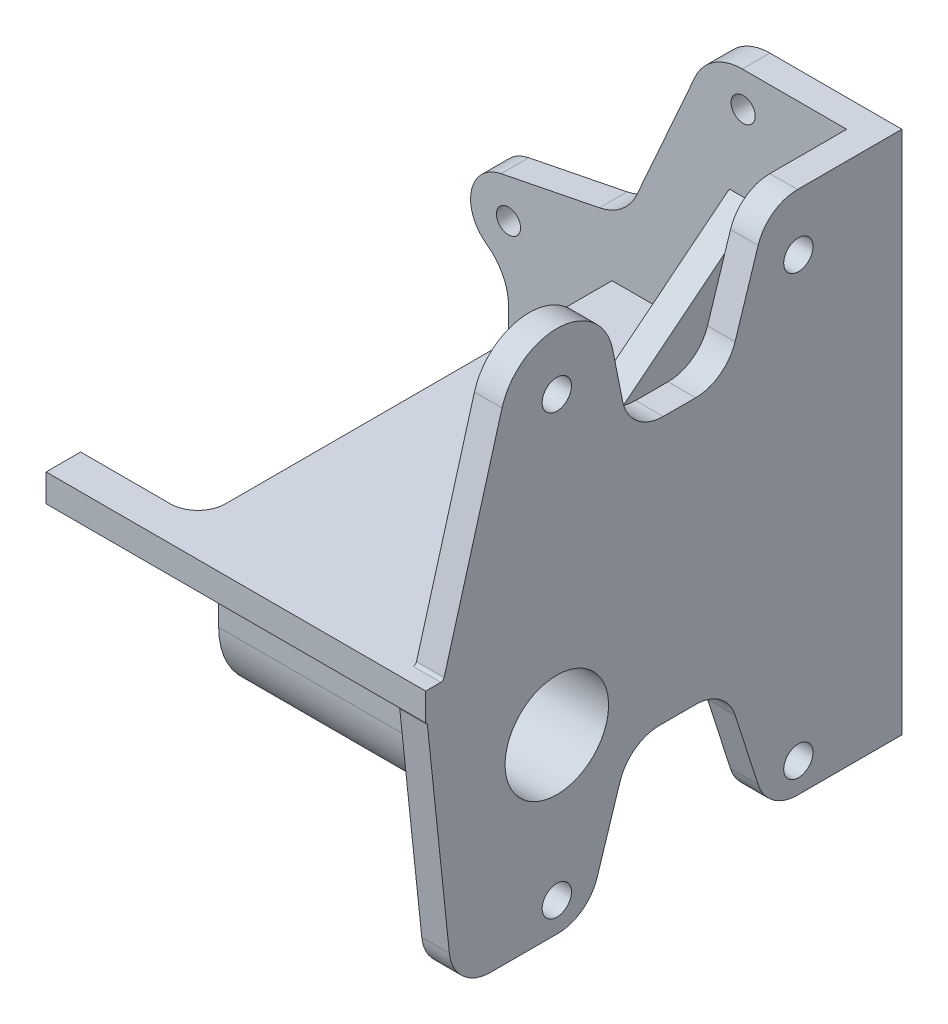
ISO-10303-21;
HEADER;
FILE_DESCRIPTION(('STEP AP214'),'2;1');
FILE_NAME('part.step','',(''),(''),'','','');
FILE_SCHEMA(('AUTOMOTIVE_DESIGN { 1 0 10303 214 1 1 1 1 }'));
ENDSEC;
DATA;
#1=APPLICATION_CONTEXT('core data for automotive mechanical design processes');
#2=APPLICATION_PROTOCOL_DEFINITION('international standard','automotive_design',2000,#1);
#3=PRODUCT_CONTEXT('',#1,'mechanical');
#4=PRODUCT('Part','Part','',(#3));
#5=PRODUCT_RELATED_PRODUCT_CATEGORY('part','',(#4));
#6=PRODUCT_DEFINITION_FORMATION('','',#4);
#7=PRODUCT_DEFINITION_CONTEXT('part definition',#1,'design');
#8=PRODUCT_DEFINITION('design','',#6,#7);
#9=PRODUCT_DEFINITION_SHAPE('','',#8);
#10=(LENGTH_UNIT() NAMED_UNIT(*) SI_UNIT(.MILLI.,.METRE.));
#11=(NAMED_UNIT(*) PLANE_ANGLE_UNIT() SI_UNIT($,.RADIAN.));
#12=(NAMED_UNIT(*) SI_UNIT($,.STERADIAN.) SOLID_ANGLE_UNIT());
#13=UNCERTAINTY_MEASURE_WITH_UNIT(LENGTH_MEASURE(1.E-05),#10,'distance_accuracy_value','');
#14=(GEOMETRIC_REPRESENTATION_CONTEXT(3) GLOBAL_UNCERTAINTY_ASSIGNED_CONTEXT((#13)) GLOBAL_UNIT_ASSIGNED_CONTEXT((#10,
#11,#12)) REPRESENTATION_CONTEXT('',''));
#15=CARTESIAN_POINT('',(0.,0.,0.));
#16=DIRECTION('',(0.,0.,1.));
#17=DIRECTION('',(1.,0.,0.));
#18=AXIS2_PLACEMENT_3D('',#15,#16,#17);
#19=CARTESIAN_POINT('',(0.,0.,8.));
#20=DIRECTION('',(0.,0.,1.));
#21=DIRECTION('',(1.,0.,0.));
#22=AXIS2_PLACEMENT_3D('',#19,#20,#21);
#23=PLANE('',#22);
#24=CARTESIAN_POINT('',(0.,0.,8.));
#25=DIRECTION('',(0.,0.,1.));
#26=DIRECTION('',(1.,0.,0.));
#27=AXIS2_PLACEMENT_3D('',#24,#25,#26);
#28=CIRCLE('',#27,3.50000000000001);
#29=CARTESIAN_POINT('',(3.50000000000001,0.,8.));
#30=VERTEX_POINT('',#29);
#31=EDGE_CURVE('E991',#30,#30,#28,.T.);
#32=ORIENTED_EDGE('',*,*,#31,.F.);
#33=EDGE_LOOP('',(#32));
#34=FACE_BOUND('',#33,.T.);
#35=CARTESIAN_POINT('',(68.,-62.,8.));
#36=DIRECTION('',(0.,0.,1.));
#37=DIRECTION('',(1.,0.,0.));
#38=AXIS2_PLACEMENT_3D('',#35,#36,#37);
#39=CIRCLE('',#38,3.50000000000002);
#40=CARTESIAN_POINT('',(71.5,-62.,8.));
#41=VERTEX_POINT('',#40);
#42=EDGE_CURVE('E997',#41,#41,#39,.T.);
#43=ORIENTED_EDGE('',*,*,#42,.F.);
#44=EDGE_LOOP('',(#43));
#45=FACE_BOUND('',#44,.T.);
#46=CARTESIAN_POINT('',(68.,62.,8.));
#47=DIRECTION('',(0.,0.,1.));
#48=DIRECTION('',(1.,0.,0.));
#49=AXIS2_PLACEMENT_3D('',#46,#47,#48);
#50=CIRCLE('',#49,3.50000000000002);
#51=CARTESIAN_POINT('',(71.5,62.,8.));
#52=VERTEX_POINT('',#51);
#53=EDGE_CURVE('E1003',#52,#52,#50,.T.);
#54=ORIENTED_EDGE('',*,*,#53,.F.);
#55=EDGE_LOOP('',(#54));
#56=FACE_BOUND('',#55,.T.);
#57=DIRECTION('',(1.,0.,0.));
#58=VECTOR('',#57,1.);
#59=CARTESIAN_POINT('',(64.,-48.,8.00000000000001));
#60=LINE('',#59,#58);
#61=CARTESIAN_POINT('',(64.,-48.,8.));
#62=VERTEX_POINT('',#61);
#63=CARTESIAN_POINT('',(72.,-48.,8.));
#64=VERTEX_POINT('',#63);
#65=EDGE_CURVE('E45',#62,#64,#60,.T.);
#66=ORIENTED_EDGE('',*,*,#65,.F.);
#67=DIRECTION('',(0.,-1.,0.));
#68=VECTOR('',#67,1.);
#69=CARTESIAN_POINT('',(64.,-48.,8.00000000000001));
#70=LINE('',#69,#68);
#71=CARTESIAN_POINT('',(64.,-7.99999999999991,8.));
#72=VERTEX_POINT('',#71);
#73=EDGE_CURVE('E363',#72,#62,#70,.T.);
#74=ORIENTED_EDGE('',*,*,#73,.F.);
#75=DIRECTION('',(1.,0.,0.));
#76=VECTOR('',#75,1.);
#77=CARTESIAN_POINT('',(0.,-7.99999999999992,8.));
#78=LINE('',#77,#76);
#79=CARTESIAN_POINT('',(30.,-7.99999999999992,8.00000000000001));
#80=VERTEX_POINT('',#79);
#81=EDGE_CURVE('E452',#80,#72,#78,.T.);
#82=ORIENTED_EDGE('',*,*,#81,.F.);
#83=DIRECTION('',(0.,1.,0.));
#84=VECTOR('',#83,1.);
#85=CARTESIAN_POINT('',(30.,0.,8.));
#86=LINE('',#85,#84);
#87=CARTESIAN_POINT('',(30.,0.,8.00000000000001));
#88=VERTEX_POINT('',#87);
#89=EDGE_CURVE('E457',#80,#88,#86,.T.);
#90=ORIENTED_EDGE('',*,*,#89,.T.);
#91=DIRECTION('',(-1.,0.,0.));
#92=VECTOR('',#91,1.);
#93=CARTESIAN_POINT('',(0.,0.,8.));
#94=LINE('',#93,#92);
#95=CARTESIAN_POINT('',(64.,0.,8.));
#96=VERTEX_POINT('',#95);
#97=EDGE_CURVE('E454',#96,#88,#94,.T.);
#98=ORIENTED_EDGE('',*,*,#97,.F.);
#99=CARTESIAN_POINT('',(64.,40.,8.));
#100=VERTEX_POINT('',#99);
#101=EDGE_CURVE('E369',#100,#96,#70,.T.);
#102=ORIENTED_EDGE('',*,*,#101,.F.);
#103=DIRECTION('',(1.,0.,0.));
#104=VECTOR('',#103,1.);
#105=CARTESIAN_POINT('',(64.,40.,8.));
#106=LINE('',#105,#104);
#107=CARTESIAN_POINT('',(72.,40.,8.));
#108=VERTEX_POINT('',#107);
#109=EDGE_CURVE('E375',#100,#108,#106,.T.);
#110=ORIENTED_EDGE('',*,*,#109,.T.);
#111=DIRECTION('',(0.,-1.,0.));
#112=VECTOR('',#111,1.);
#113=CARTESIAN_POINT('',(72.,-48.,8.00000000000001));
#114=LINE('',#113,#112);
#115=CARTESIAN_POINT('',(72.,0.,8.00000000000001));
#116=VERTEX_POINT('',#115);
#117=EDGE_CURVE('E360',#108,#116,#114,.T.);
#118=ORIENTED_EDGE('',*,*,#117,.T.);
#119=CARTESIAN_POINT('',(98.,0.,8.00000000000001));
#120=VERTEX_POINT('',#119);
#121=EDGE_CURVE('E455',#120,#116,#94,.T.);
#122=ORIENTED_EDGE('',*,*,#121,.F.);
#123=DIRECTION('',(0.,1.,0.));
#124=VECTOR('',#123,1.);
#125=CARTESIAN_POINT('',(98.,0.,8.));
#126=LINE('',#125,#124);
#127=CARTESIAN_POINT('',(98.,72.,8.));
#128=VERTEX_POINT('',#127);
#129=EDGE_CURVE('E524',#120,#128,#126,.T.);
#130=ORIENTED_EDGE('',*,*,#129,.T.);
#131=DIRECTION('',(-1.,0.,0.));
#132=VECTOR('',#131,1.);
#133=CARTESIAN_POINT('',(106.,72.,8.));
#134=LINE('',#133,#132);
#135=CARTESIAN_POINT('',(67.7480963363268,72.,8.));
#136=VERTEX_POINT('',#135);
#137=EDGE_CURVE('E548',#128,#136,#134,.T.);
#138=ORIENTED_EDGE('',*,*,#137,.T.);
#139=CARTESIAN_POINT('',(67.7480963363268,57.,8.));
#140=DIRECTION('',(0.,0.,1.));
#141=DIRECTION('',(1.,0.,0.));
#142=AXIS2_PLACEMENT_3D('',#139,#140,#141);
#143=CIRCLE('',#142,15.);
#144=CARTESIAN_POINT('',(54.040923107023,63.0920769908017,8.));
#145=VERTEX_POINT('',#144);
#146=EDGE_CURVE('E594',#136,#145,#143,.T.);
#147=ORIENTED_EDGE('',*,*,#146,.T.);
#148=DIRECTION('',(-0.406138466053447,-0.913811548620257,0.));
#149=VECTOR('',#148,1.);
#150=CARTESIAN_POINT('',(58.,72.,8.));
#151=LINE('',#150,#149);
#152=CARTESIAN_POINT('',(37.1547827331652,25.0982611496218,8.));
#153=VERTEX_POINT('',#152);
#154=EDGE_CURVE('E550',#145,#153,#151,.T.);
#155=ORIENTED_EDGE('',*,*,#154,.T.);
#156=CARTESIAN_POINT('',(23.4476095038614,31.1903381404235,8.));
#157=DIRECTION('',(0.,0.,1.));
#158=DIRECTION('',(1.,0.,0.));
#159=AXIS2_PLACEMENT_3D('',#156,#157,#158);
#160=CIRCLE('',#159,15.);
#161=CARTESIAN_POINT('',(26.3823707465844,16.4802335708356,8.));
#162=VERTEX_POINT('',#161);
#163=EDGE_CURVE('E608',#153,#162,#160,.F.);
#164=ORIENTED_EDGE('',*,*,#163,.T.);
#165=DIRECTION('',(-0.980673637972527,-0.195650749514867,0.));
#166=VECTOR('',#165,1.);
#167=CARTESIAN_POINT('',(34.,18.,8.));
#168=LINE('',#167,#166);
#169=CARTESIAN_POINT('',(-2.15215824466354,10.7874100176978,8.));
#170=VERTEX_POINT('',#169);
#171=EDGE_CURVE('E553',#162,#170,#168,.T.);
#172=ORIENTED_EDGE('',*,*,#171,.T.);
#173=CARTESIAN_POINT('',(0.,0.,8.));
#174=DIRECTION('',(0.,0.,1.));
#175=DIRECTION('',(1.,0.,0.));
#176=AXIS2_PLACEMENT_3D('',#173,#174,#175);
#177=CIRCLE('',#176,11.);
#178=CARTESIAN_POINT('',(-6.34615384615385,-8.98478332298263,8.));
#179=VERTEX_POINT('',#178);
#180=EDGE_CURVE('E555',#170,#179,#177,.T.);
#181=ORIENTED_EDGE('',*,*,#180,.T.);
#182=CARTESIAN_POINT('',(-15.,-21.2367605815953,8.));
#183=DIRECTION('',(0.,0.,1.));
#184=DIRECTION('',(1.,0.,0.));
#185=AXIS2_PLACEMENT_3D('',#182,#183,#184);
#186=CIRCLE('',#185,15.);
#187=CARTESIAN_POINT('',(0.,-21.2367605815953,8.));
#188=VERTEX_POINT('',#187);
#189=EDGE_CURVE('E604',#179,#188,#186,.F.);
#190=ORIENTED_EDGE('',*,*,#189,.T.);
#191=DIRECTION('',(0.,-1.,0.));
#192=VECTOR('',#191,1.);
#193=CARTESIAN_POINT('',(0.,-11.,8.));
#194=LINE('',#193,#192);
#195=CARTESIAN_POINT('',(0.,-65.,8.));
#196=VERTEX_POINT('',#195);
#197=EDGE_CURVE('E558',#188,#196,#194,.T.);
#198=ORIENTED_EDGE('',*,*,#197,.T.);
#199=CARTESIAN_POINT('',(15.,-65.,8.));
#200=DIRECTION('',(0.,0.,1.));
#201=DIRECTION('',(1.,0.,0.));
#202=AXIS2_PLACEMENT_3D('',#199,#200,#201);
#203=CIRCLE('',#202,15.);
#204=CARTESIAN_POINT('',(15.,-80.,8.));
#205=VERTEX_POINT('',#204);
#206=EDGE_CURVE('E592',#196,#205,#203,.T.);
#207=ORIENTED_EDGE('',*,*,#206,.T.);
#208=DIRECTION('',(1.,0.,0.));
#209=VECTOR('',#208,1.);
#210=CARTESIAN_POINT('',(106.,-80.,8.));
#211=LINE('',#210,#209);
#212=CARTESIAN_POINT('',(98.,-80.,8.));
#213=VERTEX_POINT('',#212);
#214=EDGE_CURVE('E561',#205,#213,#211,.T.);
#215=ORIENTED_EDGE('',*,*,#214,.T.);
#216=CARTESIAN_POINT('',(98.,-7.99999999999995,8.));
#217=VERTEX_POINT('',#216);
#218=EDGE_CURVE('E527',#213,#217,#126,.T.);
#219=ORIENTED_EDGE('',*,*,#218,.T.);
#220=CARTESIAN_POINT('',(72.,-7.99999999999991,8.));
#221=VERTEX_POINT('',#220);
#222=EDGE_CURVE('E448',#221,#217,#78,.T.);
#223=ORIENTED_EDGE('',*,*,#222,.F.);
#224=EDGE_CURVE('E50',#221,#64,#114,.T.);
#225=ORIENTED_EDGE('',*,*,#224,.T.);
#226=EDGE_LOOP('',(#66,#74,#82,#90,#98,#102,#110,#118,#122,#130,#138,#147,#155,#164,#172,#181,
#190,#198,#207,#215,#219,#223,#225));
#227=FACE_BOUND('',#226,.T.);
#228=ADVANCED_FACE('F30',(#34,#45,#56,#227),#23,.T.);
#229=CARTESIAN_POINT('',(30.,0.,138.));
#230=DIRECTION('',(0.,1.,0.));
#231=DIRECTION('',(-1.,0.,0.));
#232=AXIS2_PLACEMENT_3D('',#229,#230,#231);
#233=PLANE('',#232);
#234=DIRECTION('',(-1.,0.,0.));
#235=VECTOR('',#234,1.);
#236=CARTESIAN_POINT('',(30.,0.,58.0000000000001));
#237=LINE('',#236,#235);
#238=CARTESIAN_POINT('',(72.,0.,58.0000000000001));
#239=VERTEX_POINT('',#238);
#240=CARTESIAN_POINT('',(64.,0.,58.0000000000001));
#241=VERTEX_POINT('',#240);
#242=EDGE_CURVE('E11',#239,#241,#237,.T.);
#243=ORIENTED_EDGE('',*,*,#242,.T.);
#244=DIRECTION('',(0.,0.,-1.));
#245=VECTOR('',#244,1.);
#246=CARTESIAN_POINT('',(64.,0.,138.));
#247=LINE('',#246,#245);
#248=EDGE_CURVE('E380',#241,#96,#247,.T.);
#249=ORIENTED_EDGE('',*,*,#248,.T.);
#250=ORIENTED_EDGE('',*,*,#97,.T.);
#251=DIRECTION('',(0.,0.,1.));
#252=VECTOR('',#251,1.);
#253=CARTESIAN_POINT('',(30.,0.,138.));
#254=LINE('',#253,#252);
#255=CARTESIAN_POINT('',(30.,0.,120.));
#256=VERTEX_POINT('',#255);
#257=EDGE_CURVE('E441',#88,#256,#254,.T.);
#258=ORIENTED_EDGE('',*,*,#257,.T.);
#259=CARTESIAN_POINT('',(22.,0.,120.));
#260=DIRECTION('',(0.,1.,0.));
#261=DIRECTION('',(-1.,0.,0.));
#262=AXIS2_PLACEMENT_3D('',#259,#260,#261);
#263=CIRCLE('',#262,8.);
#264=CARTESIAN_POINT('',(22.,0.,128.));
#265=VERTEX_POINT('',#264);
#266=EDGE_CURVE('E356',#256,#265,#263,.F.);
#267=ORIENTED_EDGE('',*,*,#266,.T.);
#268=DIRECTION('',(1.,0.,0.));
#269=VECTOR('',#268,1.);
#270=CARTESIAN_POINT('',(-4.00000000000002,0.,128.));
#271=LINE('',#270,#269);
#272=CARTESIAN_POINT('',(-4.00000000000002,0.,128.));
#273=VERTEX_POINT('',#272);
#274=EDGE_CURVE('E431',#273,#265,#271,.T.);
#275=ORIENTED_EDGE('',*,*,#274,.F.);
#276=DIRECTION('',(0.,0.,-1.));
#277=VECTOR('',#276,1.);
#278=CARTESIAN_POINT('',(-4.00000000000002,0.,138.));
#279=LINE('',#278,#277);
#280=CARTESIAN_POINT('',(-4.00000000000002,0.,138.));
#281=VERTEX_POINT('',#280);
#282=EDGE_CURVE('E421',#281,#273,#279,.T.);
#283=ORIENTED_EDGE('',*,*,#282,.F.);
#284=DIRECTION('',(1.,0.,0.));
#285=VECTOR('',#284,1.);
#286=CARTESIAN_POINT('',(30.,0.,138.));
#287=LINE('',#286,#285);
#288=CARTESIAN_POINT('',(106.,0.,138.));
#289=VERTEX_POINT('',#288);
#290=EDGE_CURVE('E445',#281,#289,#287,.T.);
#291=ORIENTED_EDGE('',*,*,#290,.T.);
#292=DIRECTION('',(0.,0.,1.));
#293=VECTOR('',#292,1.);
#294=CARTESIAN_POINT('',(106.,0.,138.));
#295=LINE('',#294,#293);
#296=CARTESIAN_POINT('',(106.,0.,133.623276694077));
#297=VERTEX_POINT('',#296);
#298=EDGE_CURVE('E437',#297,#289,#295,.T.);
#299=ORIENTED_EDGE('',*,*,#298,.F.);
#300=DIRECTION('',(-1.,0.,0.));
#301=VECTOR('',#300,1.);
#302=CARTESIAN_POINT('',(98.,0.,133.623276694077));
#303=LINE('',#302,#301);
#304=CARTESIAN_POINT('',(98.,0.,133.623276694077));
#305=VERTEX_POINT('',#304);
#306=EDGE_CURVE('E691',#297,#305,#303,.T.);
#307=ORIENTED_EDGE('',*,*,#306,.T.);
#308=DIRECTION('',(0.,0.,1.));
#309=VECTOR('',#308,1.);
#310=CARTESIAN_POINT('',(98.,0.,100.));
#311=LINE('',#310,#309);
#312=EDGE_CURVE('E687',#120,#305,#311,.T.);
#313=ORIENTED_EDGE('',*,*,#312,.F.);
#314=ORIENTED_EDGE('',*,*,#121,.T.);
#315=DIRECTION('',(0.,0.,-1.));
#316=VECTOR('',#315,1.);
#317=CARTESIAN_POINT('',(72.,0.,138.));
#318=LINE('',#317,#316);
#319=EDGE_CURVE('E377',#239,#116,#318,.T.);
#320=ORIENTED_EDGE('',*,*,#319,.F.);
#321=EDGE_LOOP('',(#243,#249,#250,#258,#267,#275,#283,#291,#299,#307,#313,#314,#320));
#322=FACE_BOUND('',#321,.T.);
#323=ADVANCED_FACE('F715',(#322),#233,.T.);
#324=CARTESIAN_POINT('',(30.,-8.,138.));
#325=DIRECTION('',(0.,-1.,0.));
#326=DIRECTION('',(0.,0.,-1.));
#327=AXIS2_PLACEMENT_3D('',#324,#325,#326);
#328=PLANE('',#327);
#329=ORIENTED_EDGE('',*,*,#81,.T.);
#330=DIRECTION('',(0.,0.,1.));
#331=VECTOR('',#330,1.);
#332=CARTESIAN_POINT('',(64.,-7.99999999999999,138.));
#333=LINE('',#332,#331);
#334=CARTESIAN_POINT('',(64.,-7.99999999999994,58.));
#335=VERTEX_POINT('',#334);
#336=EDGE_CURVE('E38',#72,#335,#333,.T.);
#337=ORIENTED_EDGE('',*,*,#336,.T.);
#338=DIRECTION('',(1.,0.,0.));
#339=VECTOR('',#338,1.);
#340=CARTESIAN_POINT('',(30.,-7.99999999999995,58.));
#341=LINE('',#340,#339);
#342=CARTESIAN_POINT('',(72.,-7.99999999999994,58.));
#343=VERTEX_POINT('',#342);
#344=EDGE_CURVE('E341',#335,#343,#341,.T.);
#345=ORIENTED_EDGE('',*,*,#344,.T.);
#346=DIRECTION('',(0.,0.,1.));
#347=VECTOR('',#346,1.);
#348=CARTESIAN_POINT('',(72.,-7.99999999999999,138.));
#349=LINE('',#348,#347);
#350=EDGE_CURVE('E345',#221,#343,#349,.T.);
#351=ORIENTED_EDGE('',*,*,#350,.F.);
#352=ORIENTED_EDGE('',*,*,#222,.T.);
#353=DIRECTION('',(0.,0.,-1.));
#354=VECTOR('',#353,1.);
#355=CARTESIAN_POINT('',(98.,-7.99999999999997,100.));
#356=LINE('',#355,#354);
#357=CARTESIAN_POINT('',(98.,-7.99999999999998,78.));
#358=VERTEX_POINT('',#357);
#359=EDGE_CURVE('E683',#358,#217,#356,.T.);
#360=ORIENTED_EDGE('',*,*,#359,.F.);
#361=DIRECTION('',(-1.,0.,0.));
#362=VECTOR('',#361,1.);
#363=CARTESIAN_POINT('',(160.225396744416,-7.99999999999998,78.));
#364=LINE('',#363,#362);
#365=CARTESIAN_POINT('',(30.,-7.99999999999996,78.));
#366=VERTEX_POINT('',#365);
#367=EDGE_CURVE('E408',#358,#366,#364,.T.);
#368=ORIENTED_EDGE('',*,*,#367,.T.);
#369=DIRECTION('',(0.,0.,-1.));
#370=VECTOR('',#369,1.);
#371=CARTESIAN_POINT('',(30.,-8.,138.));
#372=LINE('',#371,#370);
#373=EDGE_CURVE('E439',#366,#80,#372,.T.);
#374=ORIENTED_EDGE('',*,*,#373,.T.);
#375=EDGE_LOOP('',(#329,#337,#345,#351,#352,#360,#368,#374));
#376=FACE_BOUND('',#375,.T.);
#377=ADVANCED_FACE('F344',(#376),#328,.T.);
#378=CARTESIAN_POINT('',(22.,-7.99999999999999,120.));
#379=DIRECTION('',(0.,-1.,0.));
#380=DIRECTION('',(0.,0.,-1.));
#381=AXIS2_PLACEMENT_3D('',#378,#379,#380);
#382=CIRCLE('',#381,8.);
#383=CARTESIAN_POINT('',(22.,-8.,128.));
#384=VERTEX_POINT('',#383);
#385=CARTESIAN_POINT('',(30.,-7.99999999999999,120.));
#386=VERTEX_POINT('',#385);
#387=EDGE_CURVE('E710',#384,#386,#382,.F.);
#388=ORIENTED_EDGE('',*,*,#387,.T.);
#389=DIRECTION('',(0.,0.,-1.));
#390=VECTOR('',#389,1.);
#391=CARTESIAN_POINT('',(30.,-7.99999999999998,78.));
#392=LINE('',#391,#390);
#393=CARTESIAN_POINT('',(30.,-7.99999999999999,122.));
#394=VERTEX_POINT('',#393);
#395=EDGE_CURVE('E389',#394,#386,#392,.T.);
#396=ORIENTED_EDGE('',*,*,#395,.F.);
#397=DIRECTION('',(-1.,0.,0.));
#398=VECTOR('',#397,1.);
#399=CARTESIAN_POINT('',(160.225396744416,-7.99999999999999,122.));
#400=LINE('',#399,#398);
#401=CARTESIAN_POINT('',(98.,-7.99999999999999,122.));
#402=VERTEX_POINT('',#401);
#403=EDGE_CURVE('E412',#402,#394,#400,.T.);
#404=ORIENTED_EDGE('',*,*,#403,.F.);
#405=CARTESIAN_POINT('',(98.,-7.99999999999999,138.));
#406=VERTEX_POINT('',#405);
#407=EDGE_CURVE('E684',#406,#402,#356,.T.);
#408=ORIENTED_EDGE('',*,*,#407,.F.);
#409=DIRECTION('',(1.,0.,0.));
#410=VECTOR('',#409,1.);
#411=CARTESIAN_POINT('',(30.,-8.,138.));
#412=LINE('',#411,#410);
#413=CARTESIAN_POINT('',(-4.00000000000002,-8.,138.));
#414=VERTEX_POINT('',#413);
#415=EDGE_CURVE('E449',#414,#406,#412,.T.);
#416=ORIENTED_EDGE('',*,*,#415,.F.);
#417=DIRECTION('',(0.,0.,1.));
#418=VECTOR('',#417,1.);
#419=CARTESIAN_POINT('',(-4.00000000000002,-8.,138.));
#420=LINE('',#419,#418);
#421=CARTESIAN_POINT('',(-4.00000000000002,-8.,128.));
#422=VERTEX_POINT('',#421);
#423=EDGE_CURVE('E425',#422,#414,#420,.T.);
#424=ORIENTED_EDGE('',*,*,#423,.F.);
#425=DIRECTION('',(1.,0.,0.));
#426=VECTOR('',#425,1.);
#427=CARTESIAN_POINT('',(-4.00000000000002,-8.,128.));
#428=LINE('',#427,#426);
#429=EDGE_CURVE('E428',#422,#384,#428,.T.);
#430=ORIENTED_EDGE('',*,*,#429,.T.);
#431=EDGE_LOOP('',(#388,#396,#404,#408,#416,#424,#430));
#432=FACE_BOUND('',#431,.T.);
#433=ADVANCED_FACE('F727',(#432),#328,.T.);
#434=CARTESIAN_POINT('',(30.,0.,138.));
#435=DIRECTION('',(1.,0.,0.));
#436=DIRECTION('',(0.,0.,-1.));
#437=AXIS2_PLACEMENT_3D('',#434,#435,#436);
#438=PLANE('',#437);
#439=CARTESIAN_POINT('',(30.,-30.,100.));
#440=DIRECTION('',(-1.,0.,0.));
#441=DIRECTION('',(0.,0.,1.));
#442=AXIS2_PLACEMENT_3D('',#439,#440,#441);
#443=CIRCLE('',#442,15.);
#444=CARTESIAN_POINT('',(30.,-30.,115.));
#445=VERTEX_POINT('',#444);
#446=EDGE_CURVE('E385',#445,#445,#443,.T.);
#447=ORIENTED_EDGE('',*,*,#446,.F.);
#448=EDGE_LOOP('',(#447));
#449=FACE_BOUND('',#448,.T.);
#450=ORIENTED_EDGE('',*,*,#373,.F.);
#451=DIRECTION('',(0.,-1.,0.));
#452=VECTOR('',#451,1.);
#453=CARTESIAN_POINT('',(30.,-30.,78.));
#454=LINE('',#453,#452);
#455=CARTESIAN_POINT('',(30.,-30.,78.));
#456=VERTEX_POINT('',#455);
#457=EDGE_CURVE('E388',#366,#456,#454,.T.);
#458=ORIENTED_EDGE('',*,*,#457,.T.);
#459=CARTESIAN_POINT('',(30.,-30.,100.));
#460=DIRECTION('',(-1.,0.,0.));
#461=DIRECTION('',(0.,0.,-1.));
#462=AXIS2_PLACEMENT_3D('',#459,#460,#461);
#463=CIRCLE('',#462,22.);
#464=CARTESIAN_POINT('',(30.,-30.,122.));
#465=VERTEX_POINT('',#464);
#466=EDGE_CURVE('E396',#456,#465,#463,.T.);
#467=ORIENTED_EDGE('',*,*,#466,.T.);
#468=DIRECTION('',(0.,1.,0.));
#469=VECTOR('',#468,1.);
#470=CARTESIAN_POINT('',(30.,-7.99999999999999,122.));
#471=LINE('',#470,#469);
#472=EDGE_CURVE('E393',#465,#394,#471,.T.);
#473=ORIENTED_EDGE('',*,*,#472,.T.);
#474=ORIENTED_EDGE('',*,*,#395,.T.);
#475=DIRECTION('',(0.,-1.,0.));
#476=VECTOR('',#475,1.);
#477=CARTESIAN_POINT('',(30.,0.,120.));
#478=LINE('',#477,#476);
#479=EDGE_CURVE('E708',#386,#256,#478,.F.);
#480=ORIENTED_EDGE('',*,*,#479,.T.);
#481=ORIENTED_EDGE('',*,*,#257,.F.);
#482=ORIENTED_EDGE('',*,*,#89,.F.);
#483=EDGE_LOOP('',(#450,#458,#467,#473,#474,#480,#481,#482));
#484=FACE_BOUND('',#483,.T.);
#485=ADVANCED_FACE('F847',(#449,#484),#438,.F.);
#486=CARTESIAN_POINT('',(98.,55.5,100.));
#487=DIRECTION('',(1.,0.,0.));
#488=DIRECTION('',(0.,1.,0.));
#489=AXIS2_PLACEMENT_3D('',#486,#487,#488);
#490=PLANE('',#489);
#491=CARTESIAN_POINT('',(98.,55.5,100.));
#492=DIRECTION('',(-1.,0.,0.));
#493=DIRECTION('',(0.,0.,1.));
#494=AXIS2_PLACEMENT_3D('',#491,#492,#493);
#495=CIRCLE('',#494,4.25000000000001);
#496=CARTESIAN_POINT('',(98.,55.5,104.25));
#497=VERTEX_POINT('',#496);
#498=EDGE_CURVE('E974',#497,#497,#495,.T.);
#499=ORIENTED_EDGE('',*,*,#498,.F.);
#500=EDGE_LOOP('',(#499));
#501=FACE_BOUND('',#500,.T.);
#502=CARTESIAN_POINT('',(98.,55.5,30.));
#503=DIRECTION('',(-1.,0.,0.));
#504=DIRECTION('',(0.,0.,1.));
#505=AXIS2_PLACEMENT_3D('',#502,#503,#504);
#506=CIRCLE('',#505,4.25000000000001);
#507=CARTESIAN_POINT('',(98.,55.5,34.25));
#508=VERTEX_POINT('',#507);
#509=EDGE_CURVE('E985',#508,#508,#506,.T.);
#510=ORIENTED_EDGE('',*,*,#509,.F.);
#511=EDGE_LOOP('',(#510));
#512=FACE_BOUND('',#511,.T.);
#513=ORIENTED_EDGE('',*,*,#129,.F.);
#514=ORIENTED_EDGE('',*,*,#312,.T.);
#515=CARTESIAN_POINT('',(98.,1.,133.623276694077));
#516=DIRECTION('',(1.,0.,0.));
#517=DIRECTION('',(0.,1.,0.));
#518=AXIS2_PLACEMENT_3D('',#515,#516,#517);
#519=CIRCLE('',#518,1.);
#520=CARTESIAN_POINT('',(98.,0.727506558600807,132.661119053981));
#521=VERTEX_POINT('',#520);
#522=EDGE_CURVE('E701',#305,#521,#519,.T.);
#523=ORIENTED_EDGE('',*,*,#522,.T.);
#524=DIRECTION('',(0.,-0.962157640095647,0.272493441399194));
#525=VECTOR('',#524,1.);
#526=CARTESIAN_POINT('',(98.,59.9961417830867,115.875601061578));
#527=LINE('',#526,#525);
#528=CARTESIAN_POINT('',(98.,59.9961417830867,115.875601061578));
#529=VERTEX_POINT('',#528);
#530=EDGE_CURVE('E502',#529,#521,#527,.T.);
#531=ORIENTED_EDGE('',*,*,#530,.F.);
#532=CARTESIAN_POINT('',(98.,55.5,100.));
#533=DIRECTION('',(1.,0.,0.));
#534=DIRECTION('',(0.,1.,0.));
#535=AXIS2_PLACEMENT_3D('',#532,#533,#534);
#536=CIRCLE('',#535,16.5);
#537=CARTESIAN_POINT('',(98.,58.7187243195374,83.8169899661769));
#538=VERTEX_POINT('',#537);
#539=EDGE_CURVE('E499',#538,#529,#536,.T.);
#540=ORIENTED_EDGE('',*,*,#539,.F.);
#541=DIRECTION('',(0.,0.980788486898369,0.195074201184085));
#542=VECTOR('',#541,1.);
#543=CARTESIAN_POINT('',(98.,34.5,79.));
#544=LINE('',#543,#542);
#545=CARTESIAN_POINT('',(98.,44.159109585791,80.9211513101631));
#546=VERTEX_POINT('',#545);
#547=EDGE_CURVE('E497',#546,#538,#544,.T.);
#548=ORIENTED_EDGE('',*,*,#547,.F.);
#549=CARTESIAN_POINT('',(98.,46.5,69.1516894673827));
#550=DIRECTION('',(1.,0.,0.));
#551=DIRECTION('',(0.,1.,0.));
#552=AXIS2_PLACEMENT_3D('',#549,#550,#551);
#553=CIRCLE('',#552,12.);
#554=CARTESIAN_POINT('',(98.,34.5,69.1516894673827));
#555=VERTEX_POINT('',#554);
#556=EDGE_CURVE('E681',#546,#555,#553,.T.);
#557=ORIENTED_EDGE('',*,*,#556,.T.);
#558=DIRECTION('',(0.,0.,1.));
#559=VECTOR('',#558,1.);
#560=CARTESIAN_POINT('',(98.,34.5,51.));
#561=LINE('',#560,#559);
#562=CARTESIAN_POINT('',(98.,34.5,59.7594285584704));
#563=VERTEX_POINT('',#562);
#564=EDGE_CURVE('E494',#563,#555,#561,.T.);
#565=ORIENTED_EDGE('',*,*,#564,.F.);
#566=CARTESIAN_POINT('',(98.,46.5,59.7594285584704));
#567=DIRECTION('',(1.,0.,0.));
#568=DIRECTION('',(0.,1.,0.));
#569=AXIS2_PLACEMENT_3D('',#566,#567,#568);
#570=CIRCLE('',#569,12.);
#571=CARTESIAN_POINT('',(98.,42.8426912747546,48.3303387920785));
#572=VERTEX_POINT('',#571);
#573=EDGE_CURVE('E677',#563,#572,#570,.T.);
#574=ORIENTED_EDGE('',*,*,#573,.T.);
#575=DIRECTION('',(0.,-0.952424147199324,0.304775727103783));
#576=VECTOR('',#575,1.);
#577=CARTESIAN_POINT('',(98.,72.,39.));
#578=LINE('',#577,#576);
#579=CARTESIAN_POINT('',(98.,63.6573087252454,41.6696612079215));
#580=VERTEX_POINT('',#579);
#581=EDGE_CURVE('E491',#580,#572,#578,.T.);
#582=ORIENTED_EDGE('',*,*,#581,.F.);
#583=CARTESIAN_POINT('',(98.,60.,30.2405714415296));
#584=DIRECTION('',(1.,0.,0.));
#585=DIRECTION('',(0.,1.,0.));
#586=AXIS2_PLACEMENT_3D('',#583,#584,#585);
#587=CIRCLE('',#586,12.);
#588=CARTESIAN_POINT('',(98.,72.,30.2405714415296));
#589=VERTEX_POINT('',#588);
#590=EDGE_CURVE('E626',#580,#589,#587,.F.);
#591=ORIENTED_EDGE('',*,*,#590,.T.);
#592=DIRECTION('',(0.,0.,1.));
#593=VECTOR('',#592,1.);
#594=CARTESIAN_POINT('',(98.,72.,0.));
#595=LINE('',#594,#593);
#596=EDGE_CURVE('E488',#128,#589,#595,.T.);
#597=ORIENTED_EDGE('',*,*,#596,.F.);
#598=EDGE_LOOP('',(#513,#514,#523,#531,#540,#548,#557,#565,#574,#582,#591,#597));
#599=FACE_BOUND('',#598,.T.);
#600=ADVANCED_FACE('F748',(#501,#512,#599),#490,.F.);
#601=CARTESIAN_POINT('',(106.,72.,8.));
#602=DIRECTION('',(0.,-1.,0.));
#603=DIRECTION('',(1.,0.,0.));
#604=AXIS2_PLACEMENT_3D('',#601,#602,#603);
#605=PLANE('',#604);
#606=ORIENTED_EDGE('',*,*,#596,.T.);
#607=DIRECTION('',(1.,0.,0.));
#608=VECTOR('',#607,1.);
#609=CARTESIAN_POINT('',(106.,72.,30.2405714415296));
#610=LINE('',#609,#608);
#611=CARTESIAN_POINT('',(106.,72.,30.2405714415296));
#612=VERTEX_POINT('',#611);
#613=EDGE_CURVE('E664',#589,#612,#610,.T.);
#614=ORIENTED_EDGE('',*,*,#613,.T.);
#615=DIRECTION('',(0.,0.,-1.));
#616=VECTOR('',#615,1.);
#617=CARTESIAN_POINT('',(106.,72.,8.));
#618=LINE('',#617,#616);
#619=CARTESIAN_POINT('',(106.,72.,0.));
#620=VERTEX_POINT('',#619);
#621=EDGE_CURVE('E564',#612,#620,#618,.T.);
#622=ORIENTED_EDGE('',*,*,#621,.T.);
#623=DIRECTION('',(-1.,0.,0.));
#624=VECTOR('',#623,1.);
#625=CARTESIAN_POINT('',(106.,72.,0.));
#626=LINE('',#625,#624);
#627=CARTESIAN_POINT('',(67.7480963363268,72.,0.));
#628=VERTEX_POINT('',#627);
#629=EDGE_CURVE('E530',#620,#628,#626,.T.);
#630=ORIENTED_EDGE('',*,*,#629,.T.);
#631=DIRECTION('',(0.,0.,-1.));
#632=VECTOR('',#631,1.);
#633=CARTESIAN_POINT('',(67.7480963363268,72.,8.));
#634=LINE('',#633,#632);
#635=EDGE_CURVE('E589',#628,#136,#634,.F.);
#636=ORIENTED_EDGE('',*,*,#635,.T.);
#637=ORIENTED_EDGE('',*,*,#137,.F.);
#638=EDGE_LOOP('',(#606,#614,#622,#630,#636,#637));
#639=FACE_BOUND('',#638,.T.);
#640=ADVANCED_FACE('F32',(#639),#605,.F.);
#641=CARTESIAN_POINT('',(58.,72.,8.));
#642=DIRECTION('',(0.913811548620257,-0.406138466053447,0.));
#643=DIRECTION('',(0.406138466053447,0.913811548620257,0.));
#644=AXIS2_PLACEMENT_3D('',#641,#642,#643);
#645=PLANE('',#644);
#646=ORIENTED_EDGE('',*,*,#154,.F.);
#647=DIRECTION('',(0.,0.,-1.));
#648=VECTOR('',#647,1.);
#649=CARTESIAN_POINT('',(54.040923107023,63.0920769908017,8.));
#650=LINE('',#649,#648);
#651=CARTESIAN_POINT('',(54.040923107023,63.0920769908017,0.));
#652=VERTEX_POINT('',#651);
#653=EDGE_CURVE('E581',#145,#652,#650,.T.);
#654=ORIENTED_EDGE('',*,*,#653,.T.);
#655=DIRECTION('',(-0.406138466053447,-0.913811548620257,0.));
#656=VECTOR('',#655,1.);
#657=CARTESIAN_POINT('',(58.,72.,0.));
#658=LINE('',#657,#656);
#659=CARTESIAN_POINT('',(37.1547827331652,25.0982611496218,0.));
#660=VERTEX_POINT('',#659);
#661=EDGE_CURVE('E532',#652,#660,#658,.T.);
#662=ORIENTED_EDGE('',*,*,#661,.T.);
#663=DIRECTION('',(0.,0.,-1.));
#664=VECTOR('',#663,1.);
#665=CARTESIAN_POINT('',(37.1547827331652,25.0982611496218,8.));
#666=LINE('',#665,#664);
#667=EDGE_CURVE('E579',#660,#153,#666,.F.);
#668=ORIENTED_EDGE('',*,*,#667,.T.);
#669=EDGE_LOOP('',(#646,#654,#662,#668));
#670=FACE_BOUND('',#669,.T.);
#671=ADVANCED_FACE('F803',(#670),#645,.F.);
#672=CARTESIAN_POINT('',(34.,18.,8.));
#673=DIRECTION('',(0.195650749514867,-0.980673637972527,0.));
#674=DIRECTION('',(0.980673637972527,0.195650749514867,0.));
#675=AXIS2_PLACEMENT_3D('',#672,#673,#674);
#676=PLANE('',#675);
#677=ORIENTED_EDGE('',*,*,#171,.F.);
#678=DIRECTION('',(0.,0.,-1.));
#679=VECTOR('',#678,1.);
#680=CARTESIAN_POINT('',(26.3823707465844,16.4802335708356,0.));
#681=LINE('',#680,#679);
#682=CARTESIAN_POINT('',(26.3823707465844,16.4802335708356,0.));
#683=VERTEX_POINT('',#682);
#684=EDGE_CURVE('E596',#162,#683,#681,.T.);
#685=ORIENTED_EDGE('',*,*,#684,.T.);
#686=DIRECTION('',(-0.980673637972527,-0.195650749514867,0.));
#687=VECTOR('',#686,1.);
#688=CARTESIAN_POINT('',(34.,18.,0.));
#689=LINE('',#688,#687);
#690=CARTESIAN_POINT('',(-2.15215824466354,10.7874100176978,0.));
#691=VERTEX_POINT('',#690);
#692=EDGE_CURVE('E535',#683,#691,#689,.T.);
#693=ORIENTED_EDGE('',*,*,#692,.T.);
#694=DIRECTION('',(0.,0.,-1.));
#695=VECTOR('',#694,1.);
#696=CARTESIAN_POINT('',(-2.15215824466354,10.7874100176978,8.));
#697=LINE('',#696,#695);
#698=EDGE_CURVE('E569',#170,#691,#697,.T.);
#699=ORIENTED_EDGE('',*,*,#698,.F.);
#700=EDGE_LOOP('',(#677,#685,#693,#699));
#701=FACE_BOUND('',#700,.T.);
#702=ADVANCED_FACE('F811',(#701),#676,.F.);
#703=CARTESIAN_POINT('',(0.,0.,8.));
#704=DIRECTION('',(0.,0.,-1.));
#705=DIRECTION('',(-1.,0.,0.));
#706=AXIS2_PLACEMENT_3D('',#703,#704,#705);
#707=CYLINDRICAL_SURFACE('',#706,11.);
#708=CARTESIAN_POINT('',(0.,0.,0.));
#709=DIRECTION('',(0.,0.,1.));
#710=DIRECTION('',(1.,0.,0.));
#711=AXIS2_PLACEMENT_3D('',#708,#709,#710);
#712=CIRCLE('',#711,11.);
#713=CARTESIAN_POINT('',(-6.34615384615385,-8.98478332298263,0.));
#714=VERTEX_POINT('',#713);
#715=EDGE_CURVE('E537',#691,#714,#712,.T.);
#716=ORIENTED_EDGE('',*,*,#715,.T.);
#717=DIRECTION('',(0.,0.,-1.));
#718=VECTOR('',#717,1.);
#719=CARTESIAN_POINT('',(-6.34615384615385,-8.98478332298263,8.));
#720=LINE('',#719,#718);
#721=EDGE_CURVE('E577',#714,#179,#720,.F.);
#722=ORIENTED_EDGE('',*,*,#721,.T.);
#723=ORIENTED_EDGE('',*,*,#180,.F.);
#724=ORIENTED_EDGE('',*,*,#698,.T.);
#725=EDGE_LOOP('',(#716,#722,#723,#724));
#726=FACE_BOUND('',#725,.T.);
#727=ADVANCED_FACE('F816',(#726),#707,.T.);
#728=CARTESIAN_POINT('',(0.,-11.,8.));
#729=DIRECTION('',(1.,0.,0.));
#730=DIRECTION('',(0.,1.,0.));
#731=AXIS2_PLACEMENT_3D('',#728,#729,#730);
#732=PLANE('',#731);
#733=ORIENTED_EDGE('',*,*,#197,.F.);
#734=DIRECTION('',(0.,0.,1.));
#735=VECTOR('',#734,1.);
#736=CARTESIAN_POINT('',(0.,-21.2367605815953,0.));
#737=LINE('',#736,#735);
#738=CARTESIAN_POINT('',(0.,-21.2367605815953,0.));
#739=VERTEX_POINT('',#738);
#740=EDGE_CURVE('E574',#188,#739,#737,.F.);
#741=ORIENTED_EDGE('',*,*,#740,.T.);
#742=DIRECTION('',(0.,-1.,0.));
#743=VECTOR('',#742,1.);
#744=CARTESIAN_POINT('',(0.,-11.,0.));
#745=LINE('',#744,#743);
#746=CARTESIAN_POINT('',(0.,-65.,0.));
#747=VERTEX_POINT('',#746);
#748=EDGE_CURVE('E540',#739,#747,#745,.T.);
#749=ORIENTED_EDGE('',*,*,#748,.T.);
#750=DIRECTION('',(0.,0.,-1.));
#751=VECTOR('',#750,1.);
#752=CARTESIAN_POINT('',(0.,-65.,8.));
#753=LINE('',#752,#751);
#754=EDGE_CURVE('E572',#747,#196,#753,.F.);
#755=ORIENTED_EDGE('',*,*,#754,.T.);
#756=EDGE_LOOP('',(#733,#741,#749,#755));
#757=FACE_BOUND('',#756,.T.);
#758=ADVANCED_FACE('F825',(#757),#732,.F.);
#759=CARTESIAN_POINT('',(106.,-80.,8.));
#760=DIRECTION('',(0.,1.,0.));
#761=DIRECTION('',(0.,0.,1.));
#762=AXIS2_PLACEMENT_3D('',#759,#760,#761);
#763=PLANE('',#762);
#764=DIRECTION('',(0.,0.,-1.));
#765=VECTOR('',#764,1.);
#766=CARTESIAN_POINT('',(106.,-80.,8.));
#767=LINE('',#766,#765);
#768=CARTESIAN_POINT('',(106.,-80.,30.2405714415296));
#769=VERTEX_POINT('',#768);
#770=CARTESIAN_POINT('',(106.,-80.,0.));
#771=VERTEX_POINT('',#770);
#772=EDGE_CURVE('E567',#769,#771,#767,.T.);
#773=ORIENTED_EDGE('',*,*,#772,.F.);
#774=DIRECTION('',(1.,0.,0.));
#775=VECTOR('',#774,1.);
#776=CARTESIAN_POINT('',(98.,-80.,30.2405714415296));
#777=LINE('',#776,#775);
#778=CARTESIAN_POINT('',(98.,-80.,30.2405714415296));
#779=VERTEX_POINT('',#778);
#780=EDGE_CURVE('E645',#769,#779,#777,.F.);
#781=ORIENTED_EDGE('',*,*,#780,.T.);
#782=DIRECTION('',(0.,0.,-1.));
#783=VECTOR('',#782,1.);
#784=CARTESIAN_POINT('',(98.,-80.,0.));
#785=LINE('',#784,#783);
#786=EDGE_CURVE('E519',#779,#213,#785,.T.);
#787=ORIENTED_EDGE('',*,*,#786,.T.);
#788=ORIENTED_EDGE('',*,*,#214,.F.);
#789=DIRECTION('',(0.,0.,-1.));
#790=VECTOR('',#789,1.);
#791=CARTESIAN_POINT('',(15.,-80.,8.));
#792=LINE('',#791,#790);
#793=CARTESIAN_POINT('',(15.,-80.,0.));
#794=VERTEX_POINT('',#793);
#795=EDGE_CURVE('E599',#205,#794,#792,.T.);
#796=ORIENTED_EDGE('',*,*,#795,.T.);
#797=DIRECTION('',(1.,0.,0.));
#798=VECTOR('',#797,1.);
#799=CARTESIAN_POINT('',(106.,-80.,0.));
#800=LINE('',#799,#798);
#801=EDGE_CURVE('E543',#794,#771,#800,.T.);
#802=ORIENTED_EDGE('',*,*,#801,.T.);
#803=EDGE_LOOP('',(#773,#781,#787,#788,#796,#802));
#804=FACE_BOUND('',#803,.T.);
#805=ADVANCED_FACE('F833',(#804),#763,.F.);
#806=CARTESIAN_POINT('',(106.,72.,8.));
#807=DIRECTION('',(-1.,0.,0.));
#808=DIRECTION('',(0.,-1.,0.));
#809=AXIS2_PLACEMENT_3D('',#806,#807,#808);
#810=PLANE('',#809);
#811=CARTESIAN_POINT('',(105.999999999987,-71.5,30.));
#812=DIRECTION('',(-1.,0.,0.));
#813=DIRECTION('',(0.,0.,1.));
#814=AXIS2_PLACEMENT_3D('',#811,#812,#813);
#815=CIRCLE('',#814,4.25000000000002);
#816=CARTESIAN_POINT('',(105.999999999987,-71.5,34.25));
#817=VERTEX_POINT('',#816);
#818=EDGE_CURVE('E1073',#817,#817,#815,.T.);
#819=ORIENTED_EDGE('',*,*,#818,.T.);
#820=EDGE_LOOP('',(#819));
#821=FACE_BOUND('',#820,.T.);
#822=CARTESIAN_POINT('',(105.999999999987,-71.5,100.));
#823=DIRECTION('',(-1.,0.,0.));
#824=DIRECTION('',(0.,0.,1.));
#825=AXIS2_PLACEMENT_3D('',#822,#823,#824);
#826=CIRCLE('',#825,4.25000000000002);
#827=CARTESIAN_POINT('',(105.999999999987,-71.5,104.25));
#828=VERTEX_POINT('',#827);
#829=EDGE_CURVE('E971',#828,#828,#826,.T.);
#830=ORIENTED_EDGE('',*,*,#829,.T.);
#831=EDGE_LOOP('',(#830));
#832=FACE_BOUND('',#831,.T.);
#833=CARTESIAN_POINT('',(105.999999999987,55.5,100.));
#834=DIRECTION('',(-1.,0.,0.));
#835=DIRECTION('',(0.,0.,1.));
#836=AXIS2_PLACEMENT_3D('',#833,#834,#835);
#837=CIRCLE('',#836,4.25000000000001);
#838=CARTESIAN_POINT('',(105.999999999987,55.5,104.25));
#839=VERTEX_POINT('',#838);
#840=EDGE_CURVE('E970',#839,#839,#837,.T.);
#841=ORIENTED_EDGE('',*,*,#840,.T.);
#842=EDGE_LOOP('',(#841));
#843=FACE_BOUND('',#842,.T.);
#844=CARTESIAN_POINT('',(105.999999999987,55.5,30.));
#845=DIRECTION('',(-1.,0.,0.));
#846=DIRECTION('',(0.,0.,1.));
#847=AXIS2_PLACEMENT_3D('',#844,#845,#846);
#848=CIRCLE('',#847,4.25000000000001);
#849=CARTESIAN_POINT('',(105.999999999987,55.5,34.25));
#850=VERTEX_POINT('',#849);
#851=EDGE_CURVE('E982',#850,#850,#848,.T.);
#852=ORIENTED_EDGE('',*,*,#851,.T.);
#853=EDGE_LOOP('',(#852));
#854=FACE_BOUND('',#853,.T.);
#855=CARTESIAN_POINT('',(105.999999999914,-30.,100.));
#856=DIRECTION('',(-1.,0.,0.));
#857=DIRECTION('',(0.,0.,1.));
#858=AXIS2_PLACEMENT_3D('',#855,#856,#857);
#859=CIRCLE('',#858,15.);
#860=CARTESIAN_POINT('',(105.999999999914,-30.,115.));
#861=VERTEX_POINT('',#860);
#862=EDGE_CURVE('E382',#861,#861,#859,.T.);
#863=ORIENTED_EDGE('',*,*,#862,.T.);
#864=EDGE_LOOP('',(#863));
#865=FACE_BOUND('',#864,.T.);
#866=DIRECTION('',(0.,1.,0.));
#867=VECTOR('',#866,1.);
#868=CARTESIAN_POINT('',(106.,72.,0.));
#869=LINE('',#868,#867);
#870=EDGE_CURVE('E546',#771,#620,#869,.T.);
#871=ORIENTED_EDGE('',*,*,#870,.T.);
#872=ORIENTED_EDGE('',*,*,#621,.F.);
#873=CARTESIAN_POINT('',(106.,60.,30.2405714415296));
#874=DIRECTION('',(-1.,0.,0.));
#875=DIRECTION('',(0.,-1.,0.));
#876=AXIS2_PLACEMENT_3D('',#873,#874,#875);
#877=CIRCLE('',#876,12.);
#878=CARTESIAN_POINT('',(106.,63.6573087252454,41.6696612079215));
#879=VERTEX_POINT('',#878);
#880=EDGE_CURVE('E613',#612,#879,#877,.F.);
#881=ORIENTED_EDGE('',*,*,#880,.T.);
#882=DIRECTION('',(0.,-0.952424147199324,0.304775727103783));
#883=VECTOR('',#882,1.);
#884=CARTESIAN_POINT('',(106.,72.,39.));
#885=LINE('',#884,#883);
#886=CARTESIAN_POINT('',(106.,42.8426912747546,48.3303387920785));
#887=VERTEX_POINT('',#886);
#888=EDGE_CURVE('E460',#879,#887,#885,.T.);
#889=ORIENTED_EDGE('',*,*,#888,.T.);
#890=CARTESIAN_POINT('',(106.,46.5,59.7594285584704));
#891=DIRECTION('',(-1.,0.,0.));
#892=DIRECTION('',(0.,-1.,0.));
#893=AXIS2_PLACEMENT_3D('',#890,#891,#892);
#894=CIRCLE('',#893,12.);
#895=CARTESIAN_POINT('',(106.,34.5,59.7594285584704));
#896=VERTEX_POINT('',#895);
#897=EDGE_CURVE('E675',#887,#896,#894,.T.);
#898=ORIENTED_EDGE('',*,*,#897,.T.);
#899=DIRECTION('',(0.,0.,1.));
#900=VECTOR('',#899,1.);
#901=CARTESIAN_POINT('',(106.,34.5,51.));
#902=LINE('',#901,#900);
#903=CARTESIAN_POINT('',(106.,34.5,69.1516894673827));
#904=VERTEX_POINT('',#903);
#905=EDGE_CURVE('E463',#896,#904,#902,.T.);
#906=ORIENTED_EDGE('',*,*,#905,.T.);
#907=CARTESIAN_POINT('',(106.,46.5,69.1516894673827));
#908=DIRECTION('',(-1.,0.,0.));
#909=DIRECTION('',(0.,-1.,0.));
#910=AXIS2_PLACEMENT_3D('',#907,#908,#909);
#911=CIRCLE('',#910,12.);
#912=CARTESIAN_POINT('',(106.,44.159109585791,80.9211513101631));
#913=VERTEX_POINT('',#912);
#914=EDGE_CURVE('E679',#904,#913,#911,.T.);
#915=ORIENTED_EDGE('',*,*,#914,.T.);
#916=DIRECTION('',(0.,0.980788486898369,0.195074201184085));
#917=VECTOR('',#916,1.);
#918=CARTESIAN_POINT('',(106.,34.5,79.));
#919=LINE('',#918,#917);
#920=CARTESIAN_POINT('',(106.,58.7187243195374,83.8169899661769));
#921=VERTEX_POINT('',#920);
#922=EDGE_CURVE('E466',#913,#921,#919,.T.);
#923=ORIENTED_EDGE('',*,*,#922,.T.);
#924=CARTESIAN_POINT('',(106.,55.5,100.));
#925=DIRECTION('',(1.,0.,0.));
#926=DIRECTION('',(0.,1.,0.));
#927=AXIS2_PLACEMENT_3D('',#924,#925,#926);
#928=CIRCLE('',#927,16.5);
#929=CARTESIAN_POINT('',(106.,59.9961417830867,115.875601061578));
#930=VERTEX_POINT('',#929);
#931=EDGE_CURVE('E468',#921,#930,#928,.T.);
#932=ORIENTED_EDGE('',*,*,#931,.T.);
#933=DIRECTION('',(0.,-0.962157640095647,0.272493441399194));
#934=VECTOR('',#933,1.);
#935=CARTESIAN_POINT('',(106.,59.9961417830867,115.875601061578));
#936=LINE('',#935,#934);
#937=CARTESIAN_POINT('',(106.,0.727506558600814,132.661119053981));
#938=VERTEX_POINT('',#937);
#939=EDGE_CURVE('E471',#930,#938,#936,.T.);
#940=ORIENTED_EDGE('',*,*,#939,.T.);
#941=CARTESIAN_POINT('',(106.,1.,133.623276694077));
#942=DIRECTION('',(-1.,0.,0.));
#943=DIRECTION('',(0.,-1.,0.));
#944=AXIS2_PLACEMENT_3D('',#941,#942,#943);
#945=CIRCLE('',#944,1.);
#946=EDGE_CURVE('E703',#938,#297,#945,.T.);
#947=ORIENTED_EDGE('',*,*,#946,.T.);
#948=ORIENTED_EDGE('',*,*,#298,.T.);
#949=DIRECTION('',(0.,-1.,0.));
#950=VECTOR('',#949,1.);
#951=CARTESIAN_POINT('',(106.,0.,138.));
#952=LINE('',#951,#950);
#953=CARTESIAN_POINT('',(106.,-7.99999999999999,138.));
#954=VERTEX_POINT('',#953);
#955=EDGE_CURVE('E434',#289,#954,#952,.T.);
#956=ORIENTED_EDGE('',*,*,#955,.T.);
#957=CARTESIAN_POINT('',(106.,-8.87009543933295,138.49288327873));
#958=DIRECTION('',(-1.,0.,0.));
#959=DIRECTION('',(0.,-1.,0.));
#960=AXIS2_PLACEMENT_3D('',#957,#958,#959);
#961=CIRCLE('',#960,1.);
#962=CARTESIAN_POINT('',(106.,-8.7654106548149,137.498377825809));
#963=VERTEX_POINT('',#962);
#964=EDGE_CURVE('E696',#954,#963,#961,.T.);
#965=ORIENTED_EDGE('',*,*,#964,.T.);
#966=DIRECTION('',(0.,-0.994505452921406,-0.104684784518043));
#967=VECTOR('',#966,1.);
#968=CARTESIAN_POINT('',(106.,-80.,130.));
#969=LINE('',#968,#967);
#970=CARTESIAN_POINT('',(106.,-69.2562174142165,131.130924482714));
#971=VERTEX_POINT('',#970);
#972=EDGE_CURVE('E474',#963,#971,#969,.T.);
#973=ORIENTED_EDGE('',*,*,#972,.T.);
#974=CARTESIAN_POINT('',(106.,-68.,119.196859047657));
#975=DIRECTION('',(-1.,0.,0.));
#976=DIRECTION('',(0.,-1.,0.));
#977=AXIS2_PLACEMENT_3D('',#974,#975,#976);
#978=CIRCLE('',#977,12.);
#979=CARTESIAN_POINT('',(106.,-80.,119.196859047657));
#980=VERTEX_POINT('',#979);
#981=EDGE_CURVE('E619',#971,#980,#978,.F.);
#982=ORIENTED_EDGE('',*,*,#981,.T.);
#983=DIRECTION('',(0.,0.,-1.));
#984=VECTOR('',#983,1.);
#985=CARTESIAN_POINT('',(106.,-80.,91.));
#986=LINE('',#985,#984);
#987=CARTESIAN_POINT('',(106.,-80.,99.7594285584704));
#988=VERTEX_POINT('',#987);
#989=EDGE_CURVE('E476',#980,#988,#986,.T.);
#990=ORIENTED_EDGE('',*,*,#989,.T.);
#991=CARTESIAN_POINT('',(106.,-68.,99.7594285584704));
#992=DIRECTION('',(-1.,0.,0.));
#993=DIRECTION('',(0.,-1.,0.));
#994=AXIS2_PLACEMENT_3D('',#991,#992,#993);
#995=CIRCLE('',#994,12.);
#996=CARTESIAN_POINT('',(106.,-71.6573087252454,88.3303387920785));
#997=VERTEX_POINT('',#996);
#998=EDGE_CURVE('E617',#988,#997,#995,.F.);
#999=ORIENTED_EDGE('',*,*,#998,.T.);
#1000=DIRECTION('',(0.,0.952424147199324,-0.304775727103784));
#1001=VECTOR('',#1000,1.);
#1002=CARTESIAN_POINT('',(106.,-42.5,79.));
#1003=LINE('',#1002,#1001);
#1004=CARTESIAN_POINT('',(106.,-50.8426912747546,81.6696612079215));
#1005=VERTEX_POINT('',#1004);
#1006=EDGE_CURVE('E479',#997,#1005,#1003,.T.);
#1007=ORIENTED_EDGE('',*,*,#1006,.T.);
#1008=CARTESIAN_POINT('',(106.,-54.5,70.2405714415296));
#1009=DIRECTION('',(-1.,0.,0.));
#1010=DIRECTION('',(0.,-1.,0.));
#1011=AXIS2_PLACEMENT_3D('',#1008,#1009,#1010);
#1012=CIRCLE('',#1011,12.);
#1013=CARTESIAN_POINT('',(106.,-42.5,70.2405714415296));
#1014=VERTEX_POINT('',#1013);
#1015=EDGE_CURVE('E667',#1005,#1014,#1012,.T.);
#1016=ORIENTED_EDGE('',*,*,#1015,.T.);
#1017=DIRECTION('',(0.,0.,-1.));
#1018=VECTOR('',#1017,1.);
#1019=CARTESIAN_POINT('',(106.,-42.5,51.));
#1020=LINE('',#1019,#1018);
#1021=CARTESIAN_POINT('',(106.,-42.5,59.7594285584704));
#1022=VERTEX_POINT('',#1021);
#1023=EDGE_CURVE('E482',#1014,#1022,#1020,.T.);
#1024=ORIENTED_EDGE('',*,*,#1023,.T.);
#1025=CARTESIAN_POINT('',(106.,-54.5,59.7594285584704));
#1026=DIRECTION('',(-1.,0.,0.));
#1027=DIRECTION('',(0.,-1.,0.));
#1028=AXIS2_PLACEMENT_3D('',#1025,#1026,#1027);
#1029=CIRCLE('',#1028,12.);
#1030=CARTESIAN_POINT('',(106.,-50.8426912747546,48.3303387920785));
#1031=VERTEX_POINT('',#1030);
#1032=EDGE_CURVE('E671',#1022,#1031,#1029,.T.);
#1033=ORIENTED_EDGE('',*,*,#1032,.T.);
#1034=DIRECTION('',(0.,-0.952424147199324,-0.304775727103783));
#1035=VECTOR('',#1034,1.);
#1036=CARTESIAN_POINT('',(106.,-80.,39.));
#1037=LINE('',#1036,#1035);
#1038=CARTESIAN_POINT('',(106.,-71.6573087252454,41.6696612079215));
#1039=VERTEX_POINT('',#1038);
#1040=EDGE_CURVE('E485',#1031,#1039,#1037,.T.);
#1041=ORIENTED_EDGE('',*,*,#1040,.T.);
#1042=CARTESIAN_POINT('',(106.,-68.,30.2405714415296));
#1043=DIRECTION('',(-1.,0.,0.));
#1044=DIRECTION('',(0.,-1.,0.));
#1045=AXIS2_PLACEMENT_3D('',#1042,#1043,#1044);
#1046=CIRCLE('',#1045,12.);
#1047=EDGE_CURVE('E615',#1039,#769,#1046,.F.);
#1048=ORIENTED_EDGE('',*,*,#1047,.T.);
#1049=ORIENTED_EDGE('',*,*,#772,.T.);
#1050=EDGE_LOOP('',(#871,#872,#881,#889,#898,#906,#915,#923,#932,#940,#947,#948,#956,#965,#973,
#982,#990,#999,#1007,#1016,#1024,#1033,#1041,#1048,#1049));
#1051=FACE_BOUND('',#1050,.T.);
#1052=ADVANCED_FACE('F769',(#821,#832,#843,#854,#865,#1051),#810,.F.);
#1053=CARTESIAN_POINT('',(0.,0.,0.));
#1054=DIRECTION('',(0.,0.,1.));
#1055=DIRECTION('',(1.,0.,0.));
#1056=AXIS2_PLACEMENT_3D('',#1053,#1054,#1055);
#1057=PLANE('',#1056);
#1058=CARTESIAN_POINT('',(0.,0.,1.86465426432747E-11));
#1059=DIRECTION('',(0.,0.,1.));
#1060=DIRECTION('',(1.,0.,0.));
#1061=AXIS2_PLACEMENT_3D('',#1058,#1059,#1060);
#1062=CIRCLE('',#1061,3.50000000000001);
#1063=CARTESIAN_POINT('',(3.50000000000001,0.,1.86465426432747E-11));
#1064=VERTEX_POINT('',#1063);
#1065=EDGE_CURVE('E988',#1064,#1064,#1062,.T.);
#1066=ORIENTED_EDGE('',*,*,#1065,.T.);
#1067=EDGE_LOOP('',(#1066));
#1068=FACE_BOUND('',#1067,.T.);
#1069=CARTESIAN_POINT('',(68.,-62.,1.86465426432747E-11));
#1070=DIRECTION('',(0.,0.,1.));
#1071=DIRECTION('',(1.,0.,0.));
#1072=AXIS2_PLACEMENT_3D('',#1069,#1070,#1071);
#1073=CIRCLE('',#1072,3.50000000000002);
#1074=CARTESIAN_POINT('',(71.5,-62.,1.86465426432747E-11));
#1075=VERTEX_POINT('',#1074);
#1076=EDGE_CURVE('E994',#1075,#1075,#1073,.T.);
#1077=ORIENTED_EDGE('',*,*,#1076,.T.);
#1078=EDGE_LOOP('',(#1077));
#1079=FACE_BOUND('',#1078,.T.);
#1080=CARTESIAN_POINT('',(68.,62.,1.86465426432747E-11));
#1081=DIRECTION('',(0.,0.,1.));
#1082=DIRECTION('',(1.,0.,0.));
#1083=AXIS2_PLACEMENT_3D('',#1080,#1081,#1082);
#1084=CIRCLE('',#1083,3.50000000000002);
#1085=CARTESIAN_POINT('',(71.5,62.,1.86465426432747E-11));
#1086=VERTEX_POINT('',#1085);
#1087=EDGE_CURVE('E1000',#1086,#1086,#1084,.T.);
#1088=ORIENTED_EDGE('',*,*,#1087,.T.);
#1089=EDGE_LOOP('',(#1088));
#1090=FACE_BOUND('',#1089,.T.);
#1091=ORIENTED_EDGE('',*,*,#629,.F.);
#1092=ORIENTED_EDGE('',*,*,#870,.F.);
#1093=ORIENTED_EDGE('',*,*,#801,.F.);
#1094=CARTESIAN_POINT('',(15.,-65.,0.));
#1095=DIRECTION('',(0.,0.,1.));
#1096=DIRECTION('',(1.,0.,0.));
#1097=AXIS2_PLACEMENT_3D('',#1094,#1095,#1096);
#1098=CIRCLE('',#1097,15.);
#1099=EDGE_CURVE('E584',#794,#747,#1098,.F.);
#1100=ORIENTED_EDGE('',*,*,#1099,.T.);
#1101=ORIENTED_EDGE('',*,*,#748,.F.);
#1102=CARTESIAN_POINT('',(-15.,-21.2367605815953,0.));
#1103=DIRECTION('',(0.,0.,1.));
#1104=DIRECTION('',(1.,0.,0.));
#1105=AXIS2_PLACEMENT_3D('',#1102,#1103,#1104);
#1106=CIRCLE('',#1105,15.);
#1107=EDGE_CURVE('E602',#739,#714,#1106,.T.);
#1108=ORIENTED_EDGE('',*,*,#1107,.T.);
#1109=ORIENTED_EDGE('',*,*,#715,.F.);
#1110=ORIENTED_EDGE('',*,*,#692,.F.);
#1111=CARTESIAN_POINT('',(23.4476095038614,31.1903381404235,0.));
#1112=DIRECTION('',(0.,0.,1.));
#1113=DIRECTION('',(1.,0.,0.));
#1114=AXIS2_PLACEMENT_3D('',#1111,#1112,#1113);
#1115=CIRCLE('',#1114,15.);
#1116=EDGE_CURVE('E606',#683,#660,#1115,.T.);
#1117=ORIENTED_EDGE('',*,*,#1116,.T.);
#1118=ORIENTED_EDGE('',*,*,#661,.F.);
#1119=CARTESIAN_POINT('',(67.7480963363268,57.,0.));
#1120=DIRECTION('',(0.,0.,1.));
#1121=DIRECTION('',(1.,0.,0.));
#1122=AXIS2_PLACEMENT_3D('',#1119,#1120,#1121);
#1123=CIRCLE('',#1122,15.);
#1124=EDGE_CURVE('E586',#652,#628,#1123,.F.);
#1125=ORIENTED_EDGE('',*,*,#1124,.T.);
#1126=EDGE_LOOP('',(#1091,#1092,#1093,#1100,#1101,#1108,#1109,#1110,#1117,#1118,#1125));
#1127=FACE_BOUND('',#1126,.T.);
#1128=ADVANCED_FACE('F793',(#1068,#1079,#1090,#1127),#1057,.F.);
#1129=CARTESIAN_POINT('',(-15.,-21.2367605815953,8.));
#1130=DIRECTION('',(0.,0.,-1.));
#1131=DIRECTION('',(-1.,0.,0.));
#1132=AXIS2_PLACEMENT_3D('',#1129,#1130,#1131);
#1133=CYLINDRICAL_SURFACE('',#1132,15.);
#1134=ORIENTED_EDGE('',*,*,#189,.F.);
#1135=ORIENTED_EDGE('',*,*,#721,.F.);
#1136=ORIENTED_EDGE('',*,*,#1107,.F.);
#1137=ORIENTED_EDGE('',*,*,#740,.F.);
#1138=EDGE_LOOP('',(#1134,#1135,#1136,#1137));
#1139=FACE_BOUND('',#1138,.T.);
#1140=ADVANCED_FACE('F822',(#1139),#1133,.F.);
#1141=CARTESIAN_POINT('',(67.7480963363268,57.,8.));
#1142=DIRECTION('',(0.,0.,-1.));
#1143=DIRECTION('',(-1.,0.,0.));
#1144=AXIS2_PLACEMENT_3D('',#1141,#1142,#1143);
#1145=CYLINDRICAL_SURFACE('',#1144,15.);
#1146=ORIENTED_EDGE('',*,*,#146,.F.);
#1147=ORIENTED_EDGE('',*,*,#635,.F.);
#1148=ORIENTED_EDGE('',*,*,#1124,.F.);
#1149=ORIENTED_EDGE('',*,*,#653,.F.);
#1150=EDGE_LOOP('',(#1146,#1147,#1148,#1149));
#1151=FACE_BOUND('',#1150,.T.);
#1152=ADVANCED_FACE('F799',(#1151),#1145,.T.);
#1153=CARTESIAN_POINT('',(23.4476095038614,31.1903381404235,8.));
#1154=DIRECTION('',(0.,0.,1.));
#1155=DIRECTION('',(1.,0.,0.));
#1156=AXIS2_PLACEMENT_3D('',#1153,#1154,#1155);
#1157=CYLINDRICAL_SURFACE('',#1156,15.);
#1158=ORIENTED_EDGE('',*,*,#163,.F.);
#1159=ORIENTED_EDGE('',*,*,#667,.F.);
#1160=ORIENTED_EDGE('',*,*,#1116,.F.);
#1161=ORIENTED_EDGE('',*,*,#684,.F.);
#1162=EDGE_LOOP('',(#1158,#1159,#1160,#1161));
#1163=FACE_BOUND('',#1162,.T.);
#1164=ADVANCED_FACE('F806',(#1163),#1157,.F.);
#1165=CARTESIAN_POINT('',(15.,-65.,8.));
#1166=DIRECTION('',(0.,0.,-1.));
#1167=DIRECTION('',(-1.,0.,0.));
#1168=AXIS2_PLACEMENT_3D('',#1165,#1166,#1167);
#1169=CYLINDRICAL_SURFACE('',#1168,15.);
#1170=ORIENTED_EDGE('',*,*,#206,.F.);
#1171=ORIENTED_EDGE('',*,*,#754,.F.);
#1172=ORIENTED_EDGE('',*,*,#1099,.F.);
#1173=ORIENTED_EDGE('',*,*,#795,.F.);
#1174=EDGE_LOOP('',(#1170,#1171,#1172,#1173));
#1175=FACE_BOUND('',#1174,.T.);
#1176=ADVANCED_FACE('F830',(#1175),#1169,.T.);
#1177=CARTESIAN_POINT('',(98.,-80.,39.));
#1178=DIRECTION('',(0.,-0.304775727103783,0.952424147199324));
#1179=DIRECTION('',(0.,-0.952424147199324,-0.304775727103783));
#1180=AXIS2_PLACEMENT_3D('',#1177,#1178,#1179);
#1181=PLANE('',#1180);
#1182=DIRECTION('',(0.,-0.952424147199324,-0.304775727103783));
#1183=VECTOR('',#1182,1.);
#1184=CARTESIAN_POINT('',(98.,-80.,39.));
#1185=LINE('',#1184,#1183);
#1186=CARTESIAN_POINT('',(98.,-50.8426912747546,48.3303387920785));
#1187=VERTEX_POINT('',#1186);
#1188=CARTESIAN_POINT('',(98.,-71.6573087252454,41.6696612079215));
#1189=VERTEX_POINT('',#1188);
#1190=EDGE_CURVE('E516',#1187,#1189,#1185,.T.);
#1191=ORIENTED_EDGE('',*,*,#1190,.T.);
#1192=DIRECTION('',(1.,0.,0.));
#1193=VECTOR('',#1192,1.);
#1194=CARTESIAN_POINT('',(106.,-71.6573087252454,41.6696612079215));
#1195=LINE('',#1194,#1193);
#1196=EDGE_CURVE('E642',#1189,#1039,#1195,.T.);
#1197=ORIENTED_EDGE('',*,*,#1196,.T.);
#1198=ORIENTED_EDGE('',*,*,#1040,.F.);
#1199=DIRECTION('',(1.,0.,0.));
#1200=VECTOR('',#1199,1.);
#1201=CARTESIAN_POINT('',(98.,-50.8426912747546,48.3303387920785));
#1202=LINE('',#1201,#1200);
#1203=EDGE_CURVE('E640',#1031,#1187,#1202,.F.);
#1204=ORIENTED_EDGE('',*,*,#1203,.T.);
#1205=EDGE_LOOP('',(#1191,#1197,#1198,#1204));
#1206=FACE_BOUND('',#1205,.T.);
#1207=ADVANCED_FACE('F901',(#1206),#1181,.T.);
#1208=CARTESIAN_POINT('',(98.,-42.5,51.));
#1209=DIRECTION('',(0.,-1.,0.));
#1210=DIRECTION('',(0.,0.,-1.));
#1211=AXIS2_PLACEMENT_3D('',#1208,#1209,#1210);
#1212=PLANE('',#1211);
#1213=ORIENTED_EDGE('',*,*,#1023,.F.);
#1214=DIRECTION('',(1.,0.,0.));
#1215=VECTOR('',#1214,1.);
#1216=CARTESIAN_POINT('',(98.,-42.5,70.2405714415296));
#1217=LINE('',#1216,#1215);
#1218=CARTESIAN_POINT('',(98.,-42.5,70.2405714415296));
#1219=VERTEX_POINT('',#1218);
#1220=EDGE_CURVE('E650',#1014,#1219,#1217,.F.);
#1221=ORIENTED_EDGE('',*,*,#1220,.T.);
#1222=DIRECTION('',(0.,0.,-1.));
#1223=VECTOR('',#1222,1.);
#1224=CARTESIAN_POINT('',(98.,-42.5,51.));
#1225=LINE('',#1224,#1223);
#1226=CARTESIAN_POINT('',(98.,-42.5,59.7594285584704));
#1227=VERTEX_POINT('',#1226);
#1228=EDGE_CURVE('E513',#1219,#1227,#1225,.T.);
#1229=ORIENTED_EDGE('',*,*,#1228,.T.);
#1230=DIRECTION('',(1.,0.,0.));
#1231=VECTOR('',#1230,1.);
#1232=CARTESIAN_POINT('',(106.,-42.5,59.7594285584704));
#1233=LINE('',#1232,#1231);
#1234=EDGE_CURVE('E647',#1227,#1022,#1233,.T.);
#1235=ORIENTED_EDGE('',*,*,#1234,.T.);
#1236=EDGE_LOOP('',(#1213,#1221,#1229,#1235));
#1237=FACE_BOUND('',#1236,.T.);
#1238=ADVANCED_FACE('F892',(#1237),#1212,.T.);
#1239=CARTESIAN_POINT('',(98.,-42.5,79.));
#1240=DIRECTION('',(0.,-0.304775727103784,-0.952424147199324));
#1241=DIRECTION('',(0.,0.952424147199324,-0.304775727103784));
#1242=AXIS2_PLACEMENT_3D('',#1239,#1240,#1241);
#1243=PLANE('',#1242);
#1244=ORIENTED_EDGE('',*,*,#1006,.F.);
#1245=DIRECTION('',(1.,0.,0.));
#1246=VECTOR('',#1245,1.);
#1247=CARTESIAN_POINT('',(98.,-71.6573087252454,88.3303387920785));
#1248=LINE('',#1247,#1246);
#1249=CARTESIAN_POINT('',(98.,-71.6573087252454,88.3303387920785));
#1250=VERTEX_POINT('',#1249);
#1251=EDGE_CURVE('E638',#997,#1250,#1248,.F.);
#1252=ORIENTED_EDGE('',*,*,#1251,.T.);
#1253=DIRECTION('',(0.,0.952424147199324,-0.304775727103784));
#1254=VECTOR('',#1253,1.);
#1255=CARTESIAN_POINT('',(98.,-42.5,79.));
#1256=LINE('',#1255,#1254);
#1257=CARTESIAN_POINT('',(98.,-50.8426912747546,81.6696612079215));
#1258=VERTEX_POINT('',#1257);
#1259=EDGE_CURVE('E510',#1250,#1258,#1256,.T.);
#1260=ORIENTED_EDGE('',*,*,#1259,.T.);
#1261=DIRECTION('',(1.,0.,0.));
#1262=VECTOR('',#1261,1.);
#1263=CARTESIAN_POINT('',(106.,-50.8426912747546,81.6696612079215));
#1264=LINE('',#1263,#1262);
#1265=EDGE_CURVE('E635',#1258,#1005,#1264,.T.);
#1266=ORIENTED_EDGE('',*,*,#1265,.T.);
#1267=EDGE_LOOP('',(#1244,#1252,#1260,#1266));
#1268=FACE_BOUND('',#1267,.T.);
#1269=ADVANCED_FACE('F883',(#1268),#1243,.T.);
#1270=CARTESIAN_POINT('',(98.,-80.,91.));
#1271=DIRECTION('',(0.,-1.,0.));
#1272=DIRECTION('',(1.,0.,0.));
#1273=AXIS2_PLACEMENT_3D('',#1270,#1271,#1272);
#1274=PLANE('',#1273);
#1275=ORIENTED_EDGE('',*,*,#989,.F.);
#1276=DIRECTION('',(1.,0.,0.));
#1277=VECTOR('',#1276,1.);
#1278=CARTESIAN_POINT('',(98.,-80.,119.196859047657));
#1279=LINE('',#1278,#1277);
#1280=CARTESIAN_POINT('',(98.,-80.,119.196859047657));
#1281=VERTEX_POINT('',#1280);
#1282=EDGE_CURVE('E624',#980,#1281,#1279,.F.);
#1283=ORIENTED_EDGE('',*,*,#1282,.T.);
#1284=DIRECTION('',(0.,0.,-1.));
#1285=VECTOR('',#1284,1.);
#1286=CARTESIAN_POINT('',(98.,-80.,91.));
#1287=LINE('',#1286,#1285);
#1288=CARTESIAN_POINT('',(98.,-80.,99.7594285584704));
#1289=VERTEX_POINT('',#1288);
#1290=EDGE_CURVE('E507',#1281,#1289,#1287,.T.);
#1291=ORIENTED_EDGE('',*,*,#1290,.T.);
#1292=DIRECTION('',(1.,0.,0.));
#1293=VECTOR('',#1292,1.);
#1294=CARTESIAN_POINT('',(98.,-80.,99.7594285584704));
#1295=LINE('',#1294,#1293);
#1296=EDGE_CURVE('E621',#1289,#988,#1295,.T.);
#1297=ORIENTED_EDGE('',*,*,#1296,.T.);
#1298=EDGE_LOOP('',(#1275,#1283,#1291,#1297));
#1299=FACE_BOUND('',#1298,.T.);
#1300=ADVANCED_FACE('F874',(#1299),#1274,.T.);
#1301=CARTESIAN_POINT('',(98.,-80.,130.));
#1302=DIRECTION('',(0.,-0.104684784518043,0.994505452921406));
#1303=DIRECTION('',(0.,-0.994505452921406,-0.104684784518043));
#1304=AXIS2_PLACEMENT_3D('',#1301,#1302,#1303);
#1305=PLANE('',#1304);
#1306=ORIENTED_EDGE('',*,*,#972,.F.);
#1307=DIRECTION('',(1.,0.,0.));
#1308=VECTOR('',#1307,1.);
#1309=CARTESIAN_POINT('',(98.,-8.76541065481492,137.498377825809));
#1310=LINE('',#1309,#1308);
#1311=CARTESIAN_POINT('',(98.,-8.7654106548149,137.498377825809));
#1312=VERTEX_POINT('',#1311);
#1313=EDGE_CURVE('E689',#963,#1312,#1310,.F.);
#1314=ORIENTED_EDGE('',*,*,#1313,.T.);
#1315=DIRECTION('',(0.,-0.994505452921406,-0.104684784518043));
#1316=VECTOR('',#1315,1.);
#1317=CARTESIAN_POINT('',(98.,-80.,130.));
#1318=LINE('',#1317,#1316);
#1319=CARTESIAN_POINT('',(98.,-69.2562174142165,131.130924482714));
#1320=VERTEX_POINT('',#1319);
#1321=EDGE_CURVE('E505',#1312,#1320,#1318,.T.);
#1322=ORIENTED_EDGE('',*,*,#1321,.T.);
#1323=DIRECTION('',(1.,0.,0.));
#1324=VECTOR('',#1323,1.);
#1325=CARTESIAN_POINT('',(98.,-69.2562174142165,131.130924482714));
#1326=LINE('',#1325,#1324);
#1327=EDGE_CURVE('E610',#1320,#971,#1326,.T.);
#1328=ORIENTED_EDGE('',*,*,#1327,.T.);
#1329=EDGE_LOOP('',(#1306,#1314,#1322,#1328));
#1330=FACE_BOUND('',#1329,.T.);
#1331=ADVANCED_FACE('F866',(#1330),#1305,.T.);
#1332=CARTESIAN_POINT('',(98.,59.9961417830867,115.875601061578));
#1333=DIRECTION('',(0.,0.272493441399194,0.962157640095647));
#1334=DIRECTION('',(0.,-0.962157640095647,0.272493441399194));
#1335=AXIS2_PLACEMENT_3D('',#1332,#1333,#1334);
#1336=PLANE('',#1335);
#1337=ORIENTED_EDGE('',*,*,#530,.T.);
#1338=DIRECTION('',(-1.,0.,0.));
#1339=VECTOR('',#1338,1.);
#1340=CARTESIAN_POINT('',(106.,0.727506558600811,132.661119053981));
#1341=LINE('',#1340,#1339);
#1342=EDGE_CURVE('E694',#521,#938,#1341,.F.);
#1343=ORIENTED_EDGE('',*,*,#1342,.T.);
#1344=ORIENTED_EDGE('',*,*,#939,.F.);
#1345=DIRECTION('',(1.,0.,0.));
#1346=VECTOR('',#1345,1.);
#1347=CARTESIAN_POINT('',(98.,59.9961417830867,115.875601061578));
#1348=LINE('',#1347,#1346);
#1349=EDGE_CURVE('E522',#529,#930,#1348,.T.);
#1350=ORIENTED_EDGE('',*,*,#1349,.F.);
#1351=EDGE_LOOP('',(#1337,#1343,#1344,#1350));
#1352=FACE_BOUND('',#1351,.T.);
#1353=ADVANCED_FACE('F751',(#1352),#1336,.T.);
#1354=CARTESIAN_POINT('',(98.,55.5,100.));
#1355=DIRECTION('',(1.,0.,0.));
#1356=DIRECTION('',(0.,1.,0.));
#1357=AXIS2_PLACEMENT_3D('',#1354,#1355,#1356);
#1358=CYLINDRICAL_SURFACE('',#1357,16.5);
#1359=ORIENTED_EDGE('',*,*,#931,.F.);
#1360=DIRECTION('',(1.,0.,0.));
#1361=VECTOR('',#1360,1.);
#1362=CARTESIAN_POINT('',(98.,58.7187243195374,83.8169899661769));
#1363=LINE('',#1362,#1361);
#1364=EDGE_CURVE('E521',#538,#921,#1363,.T.);
#1365=ORIENTED_EDGE('',*,*,#1364,.F.);
#1366=ORIENTED_EDGE('',*,*,#539,.T.);
#1367=ORIENTED_EDGE('',*,*,#1349,.T.);
#1368=EDGE_LOOP('',(#1359,#1365,#1366,#1367));
#1369=FACE_BOUND('',#1368,.T.);
#1370=ADVANCED_FACE('F755',(#1369),#1358,.T.);
#1371=CARTESIAN_POINT('',(98.,34.5,79.));
#1372=DIRECTION('',(0.,0.195074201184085,-0.980788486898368));
#1373=DIRECTION('',(0.,0.980788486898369,0.195074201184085));
#1374=AXIS2_PLACEMENT_3D('',#1371,#1372,#1373);
#1375=PLANE('',#1374);
#1376=ORIENTED_EDGE('',*,*,#922,.F.);
#1377=DIRECTION('',(1.,0.,0.));
#1378=VECTOR('',#1377,1.);
#1379=CARTESIAN_POINT('',(98.,44.159109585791,80.9211513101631));
#1380=LINE('',#1379,#1378);
#1381=EDGE_CURVE('E662',#913,#546,#1380,.F.);
#1382=ORIENTED_EDGE('',*,*,#1381,.T.);
#1383=ORIENTED_EDGE('',*,*,#547,.T.);
#1384=ORIENTED_EDGE('',*,*,#1364,.T.);
#1385=EDGE_LOOP('',(#1376,#1382,#1383,#1384));
#1386=FACE_BOUND('',#1385,.T.);
#1387=ADVANCED_FACE('F1424',(#1386),#1375,.T.);
#1388=CARTESIAN_POINT('',(98.,34.5,51.));
#1389=DIRECTION('',(0.,1.,0.));
#1390=DIRECTION('',(0.,0.,1.));
#1391=AXIS2_PLACEMENT_3D('',#1388,#1389,#1390);
#1392=PLANE('',#1391);
#1393=ORIENTED_EDGE('',*,*,#905,.F.);
#1394=DIRECTION('',(1.,0.,0.));
#1395=VECTOR('',#1394,1.);
#1396=CARTESIAN_POINT('',(98.,34.5,59.7594285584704));
#1397=LINE('',#1396,#1395);
#1398=EDGE_CURVE('E660',#896,#563,#1397,.F.);
#1399=ORIENTED_EDGE('',*,*,#1398,.T.);
#1400=ORIENTED_EDGE('',*,*,#564,.T.);
#1401=DIRECTION('',(1.,0.,0.));
#1402=VECTOR('',#1401,1.);
#1403=CARTESIAN_POINT('',(106.,34.5,69.1516894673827));
#1404=LINE('',#1403,#1402);
#1405=EDGE_CURVE('E657',#555,#904,#1404,.T.);
#1406=ORIENTED_EDGE('',*,*,#1405,.T.);
#1407=EDGE_LOOP('',(#1393,#1399,#1400,#1406));
#1408=FACE_BOUND('',#1407,.T.);
#1409=ADVANCED_FACE('F767',(#1408),#1392,.T.);
#1410=CARTESIAN_POINT('',(98.,72.,39.));
#1411=DIRECTION('',(0.,0.304775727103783,0.952424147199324));
#1412=DIRECTION('',(0.,-0.952424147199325,0.304775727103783));
#1413=AXIS2_PLACEMENT_3D('',#1410,#1411,#1412);
#1414=PLANE('',#1413);
#1415=ORIENTED_EDGE('',*,*,#581,.T.);
#1416=DIRECTION('',(1.,0.,0.));
#1417=VECTOR('',#1416,1.);
#1418=CARTESIAN_POINT('',(106.,42.8426912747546,48.3303387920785));
#1419=LINE('',#1418,#1417);
#1420=EDGE_CURVE('E654',#572,#887,#1419,.T.);
#1421=ORIENTED_EDGE('',*,*,#1420,.T.);
#1422=ORIENTED_EDGE('',*,*,#888,.F.);
#1423=DIRECTION('',(1.,0.,0.));
#1424=VECTOR('',#1423,1.);
#1425=CARTESIAN_POINT('',(98.,63.6573087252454,41.6696612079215));
#1426=LINE('',#1425,#1424);
#1427=EDGE_CURVE('E652',#879,#580,#1426,.F.);
#1428=ORIENTED_EDGE('',*,*,#1427,.T.);
#1429=EDGE_LOOP('',(#1415,#1421,#1422,#1428));
#1430=FACE_BOUND('',#1429,.T.);
#1431=ADVANCED_FACE('F777',(#1430),#1414,.T.);
#1432=CARTESIAN_POINT('',(98.,-71.5,30.));
#1433=DIRECTION('',(-1.,0.,0.));
#1434=DIRECTION('',(0.,0.,1.));
#1435=AXIS2_PLACEMENT_3D('',#1432,#1433,#1434);
#1436=CIRCLE('',#1435,4.25000000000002);
#1437=CARTESIAN_POINT('',(98.,-71.5,34.25));
#1438=VERTEX_POINT('',#1437);
#1439=EDGE_CURVE('E965',#1438,#1438,#1436,.T.);
#1440=ORIENTED_EDGE('',*,*,#1439,.F.);
#1441=EDGE_LOOP('',(#1440));
#1442=FACE_BOUND('',#1441,.T.);
#1443=CARTESIAN_POINT('',(98.,-71.5,100.));
#1444=DIRECTION('',(-1.,0.,0.));
#1445=DIRECTION('',(0.,0.,1.));
#1446=AXIS2_PLACEMENT_3D('',#1443,#1444,#1445);
#1447=CIRCLE('',#1446,4.25000000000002);
#1448=CARTESIAN_POINT('',(98.,-71.5,104.25));
#1449=VERTEX_POINT('',#1448);
#1450=EDGE_CURVE('E968',#1449,#1449,#1447,.T.);
#1451=ORIENTED_EDGE('',*,*,#1450,.F.);
#1452=EDGE_LOOP('',(#1451));
#1453=FACE_BOUND('',#1452,.T.);
#1454=ORIENTED_EDGE('',*,*,#407,.T.);
#1455=DIRECTION('',(0.,1.,0.));
#1456=VECTOR('',#1455,1.);
#1457=CARTESIAN_POINT('',(98.,-7.99999999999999,122.));
#1458=LINE('',#1457,#1456);
#1459=CARTESIAN_POINT('',(98.,-30.,122.));
#1460=VERTEX_POINT('',#1459);
#1461=EDGE_CURVE('E409',#1460,#402,#1458,.T.);
#1462=ORIENTED_EDGE('',*,*,#1461,.F.);
#1463=CARTESIAN_POINT('',(98.,-30.,100.));
#1464=DIRECTION('',(1.,0.,0.));
#1465=DIRECTION('',(0.,1.,0.));
#1466=AXIS2_PLACEMENT_3D('',#1463,#1464,#1465);
#1467=CIRCLE('',#1466,22.);
#1468=CARTESIAN_POINT('',(98.,-30.,78.));
#1469=VERTEX_POINT('',#1468);
#1470=EDGE_CURVE('E392',#1469,#1460,#1467,.F.);
#1471=ORIENTED_EDGE('',*,*,#1470,.F.);
#1472=DIRECTION('',(0.,-1.,0.));
#1473=VECTOR('',#1472,1.);
#1474=CARTESIAN_POINT('',(98.,-30.,78.));
#1475=LINE('',#1474,#1473);
#1476=EDGE_CURVE('E404',#358,#1469,#1475,.T.);
#1477=ORIENTED_EDGE('',*,*,#1476,.F.);
#1478=ORIENTED_EDGE('',*,*,#359,.T.);
#1479=ORIENTED_EDGE('',*,*,#218,.F.);
#1480=ORIENTED_EDGE('',*,*,#786,.F.);
#1481=CARTESIAN_POINT('',(98.,-68.,30.2405714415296));
#1482=DIRECTION('',(1.,0.,0.));
#1483=DIRECTION('',(0.,1.,0.));
#1484=AXIS2_PLACEMENT_3D('',#1481,#1482,#1483);
#1485=CIRCLE('',#1484,12.);
#1486=EDGE_CURVE('E628',#779,#1189,#1485,.F.);
#1487=ORIENTED_EDGE('',*,*,#1486,.T.);
#1488=ORIENTED_EDGE('',*,*,#1190,.F.);
#1489=CARTESIAN_POINT('',(98.,-54.5,59.7594285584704));
#1490=DIRECTION('',(1.,0.,0.));
#1491=DIRECTION('',(0.,1.,0.));
#1492=AXIS2_PLACEMENT_3D('',#1489,#1490,#1491);
#1493=CIRCLE('',#1492,12.);
#1494=EDGE_CURVE('E673',#1187,#1227,#1493,.T.);
#1495=ORIENTED_EDGE('',*,*,#1494,.T.);
#1496=ORIENTED_EDGE('',*,*,#1228,.F.);
#1497=CARTESIAN_POINT('',(98.,-54.5,70.2405714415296));
#1498=DIRECTION('',(1.,0.,0.));
#1499=DIRECTION('',(0.,1.,0.));
#1500=AXIS2_PLACEMENT_3D('',#1497,#1498,#1499);
#1501=CIRCLE('',#1500,12.);
#1502=EDGE_CURVE('E669',#1219,#1258,#1501,.T.);
#1503=ORIENTED_EDGE('',*,*,#1502,.T.);
#1504=ORIENTED_EDGE('',*,*,#1259,.F.);
#1505=CARTESIAN_POINT('',(98.,-68.,99.7594285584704));
#1506=DIRECTION('',(1.,0.,0.));
#1507=DIRECTION('',(0.,1.,0.));
#1508=AXIS2_PLACEMENT_3D('',#1505,#1506,#1507);
#1509=CIRCLE('',#1508,12.);
#1510=EDGE_CURVE('E630',#1250,#1289,#1509,.F.);
#1511=ORIENTED_EDGE('',*,*,#1510,.T.);
#1512=ORIENTED_EDGE('',*,*,#1290,.F.);
#1513=CARTESIAN_POINT('',(98.,-68.,119.196859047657));
#1514=DIRECTION('',(1.,0.,0.));
#1515=DIRECTION('',(0.,1.,0.));
#1516=AXIS2_PLACEMENT_3D('',#1513,#1514,#1515);
#1517=CIRCLE('',#1516,12.);
#1518=EDGE_CURVE('E632',#1281,#1320,#1517,.F.);
#1519=ORIENTED_EDGE('',*,*,#1518,.T.);
#1520=ORIENTED_EDGE('',*,*,#1321,.F.);
#1521=CARTESIAN_POINT('',(98.,-8.87009543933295,138.49288327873));
#1522=DIRECTION('',(1.,0.,0.));
#1523=DIRECTION('',(0.,1.,0.));
#1524=AXIS2_PLACEMENT_3D('',#1521,#1522,#1523);
#1525=CIRCLE('',#1524,1.);
#1526=EDGE_CURVE('E698',#1312,#406,#1525,.T.);
#1527=ORIENTED_EDGE('',*,*,#1526,.T.);
#1528=EDGE_LOOP('',(#1454,#1462,#1471,#1477,#1478,#1479,#1480,#1487,#1488,#1495,#1496,#1503,
#1504,#1511,#1512,#1519,#1520,#1527));
#1529=FACE_BOUND('',#1528,.T.);
#1530=ADVANCED_FACE('F838',(#1442,#1453,#1529),#490,.F.);
#1531=CARTESIAN_POINT('',(98.,-68.,119.196859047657));
#1532=DIRECTION('',(1.,0.,0.));
#1533=DIRECTION('',(0.,1.,0.));
#1534=AXIS2_PLACEMENT_3D('',#1531,#1532,#1533);
#1535=CYLINDRICAL_SURFACE('',#1534,12.);
#1536=ORIENTED_EDGE('',*,*,#1518,.F.);
#1537=ORIENTED_EDGE('',*,*,#1282,.F.);
#1538=ORIENTED_EDGE('',*,*,#981,.F.);
#1539=ORIENTED_EDGE('',*,*,#1327,.F.);
#1540=EDGE_LOOP('',(#1536,#1537,#1538,#1539));
#1541=FACE_BOUND('',#1540,.T.);
#1542=ADVANCED_FACE('F870',(#1541),#1535,.T.);
#1543=CARTESIAN_POINT('',(98.,-68.,99.7594285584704));
#1544=DIRECTION('',(1.,0.,0.));
#1545=DIRECTION('',(0.,1.,0.));
#1546=AXIS2_PLACEMENT_3D('',#1543,#1544,#1545);
#1547=CYLINDRICAL_SURFACE('',#1546,12.);
#1548=ORIENTED_EDGE('',*,*,#1510,.F.);
#1549=ORIENTED_EDGE('',*,*,#1251,.F.);
#1550=ORIENTED_EDGE('',*,*,#998,.F.);
#1551=ORIENTED_EDGE('',*,*,#1296,.F.);
#1552=EDGE_LOOP('',(#1548,#1549,#1550,#1551));
#1553=FACE_BOUND('',#1552,.T.);
#1554=ADVANCED_FACE('F879',(#1553),#1547,.T.);
#1555=CARTESIAN_POINT('',(98.,-68.,30.2405714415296));
#1556=DIRECTION('',(-1.,0.,0.));
#1557=DIRECTION('',(0.,0.,1.));
#1558=AXIS2_PLACEMENT_3D('',#1555,#1556,#1557);
#1559=CYLINDRICAL_SURFACE('',#1558,12.);
#1560=ORIENTED_EDGE('',*,*,#1486,.F.);
#1561=ORIENTED_EDGE('',*,*,#780,.F.);
#1562=ORIENTED_EDGE('',*,*,#1047,.F.);
#1563=ORIENTED_EDGE('',*,*,#1196,.F.);
#1564=EDGE_LOOP('',(#1560,#1561,#1562,#1563));
#1565=FACE_BOUND('',#1564,.T.);
#1566=ADVANCED_FACE('F905',(#1565),#1559,.T.);
#1567=CARTESIAN_POINT('',(98.,-54.5,70.2405714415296));
#1568=DIRECTION('',(-1.,0.,0.));
#1569=DIRECTION('',(0.,-1.,0.));
#1570=AXIS2_PLACEMENT_3D('',#1567,#1568,#1569);
#1571=CYLINDRICAL_SURFACE('',#1570,12.);
#1572=ORIENTED_EDGE('',*,*,#1502,.F.);
#1573=ORIENTED_EDGE('',*,*,#1220,.F.);
#1574=ORIENTED_EDGE('',*,*,#1015,.F.);
#1575=ORIENTED_EDGE('',*,*,#1265,.F.);
#1576=EDGE_LOOP('',(#1572,#1573,#1574,#1575));
#1577=FACE_BOUND('',#1576,.T.);
#1578=ADVANCED_FACE('F888',(#1577),#1571,.F.);
#1579=CARTESIAN_POINT('',(98.,-54.5,59.7594285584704));
#1580=DIRECTION('',(-1.,0.,0.));
#1581=DIRECTION('',(0.,-1.,0.));
#1582=AXIS2_PLACEMENT_3D('',#1579,#1580,#1581);
#1583=CYLINDRICAL_SURFACE('',#1582,12.);
#1584=ORIENTED_EDGE('',*,*,#1494,.F.);
#1585=ORIENTED_EDGE('',*,*,#1203,.F.);
#1586=ORIENTED_EDGE('',*,*,#1032,.F.);
#1587=ORIENTED_EDGE('',*,*,#1234,.F.);
#1588=EDGE_LOOP('',(#1584,#1585,#1586,#1587));
#1589=FACE_BOUND('',#1588,.T.);
#1590=ADVANCED_FACE('F897',(#1589),#1583,.F.);
#1591=CARTESIAN_POINT('',(98.,46.5,59.7594285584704));
#1592=DIRECTION('',(-1.,0.,0.));
#1593=DIRECTION('',(0.,-1.,0.));
#1594=AXIS2_PLACEMENT_3D('',#1591,#1592,#1593);
#1595=CYLINDRICAL_SURFACE('',#1594,12.);
#1596=ORIENTED_EDGE('',*,*,#573,.F.);
#1597=ORIENTED_EDGE('',*,*,#1398,.F.);
#1598=ORIENTED_EDGE('',*,*,#897,.F.);
#1599=ORIENTED_EDGE('',*,*,#1420,.F.);
#1600=EDGE_LOOP('',(#1596,#1597,#1598,#1599));
#1601=FACE_BOUND('',#1600,.T.);
#1602=ADVANCED_FACE('F775',(#1601),#1595,.F.);
#1603=CARTESIAN_POINT('',(98.,46.5,69.1516894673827));
#1604=DIRECTION('',(-1.,0.,0.));
#1605=DIRECTION('',(0.,-1.,0.));
#1606=AXIS2_PLACEMENT_3D('',#1603,#1604,#1605);
#1607=CYLINDRICAL_SURFACE('',#1606,12.);
#1608=ORIENTED_EDGE('',*,*,#556,.F.);
#1609=ORIENTED_EDGE('',*,*,#1381,.F.);
#1610=ORIENTED_EDGE('',*,*,#914,.F.);
#1611=ORIENTED_EDGE('',*,*,#1405,.F.);
#1612=EDGE_LOOP('',(#1608,#1609,#1610,#1611));
#1613=FACE_BOUND('',#1612,.T.);
#1614=ADVANCED_FACE('F764',(#1613),#1607,.F.);
#1615=CARTESIAN_POINT('',(106.,60.,30.2405714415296));
#1616=DIRECTION('',(-1.,0.,0.));
#1617=DIRECTION('',(0.,-1.,0.));
#1618=AXIS2_PLACEMENT_3D('',#1615,#1616,#1617);
#1619=CYLINDRICAL_SURFACE('',#1618,12.);
#1620=ORIENTED_EDGE('',*,*,#590,.F.);
#1621=ORIENTED_EDGE('',*,*,#1427,.F.);
#1622=ORIENTED_EDGE('',*,*,#880,.F.);
#1623=ORIENTED_EDGE('',*,*,#613,.F.);
#1624=EDGE_LOOP('',(#1620,#1621,#1622,#1623));
#1625=FACE_BOUND('',#1624,.T.);
#1626=ADVANCED_FACE('F784',(#1625),#1619,.T.);
#1627=CARTESIAN_POINT('',(30.,0.,138.));
#1628=DIRECTION('',(0.,0.,1.));
#1629=DIRECTION('',(1.,0.,0.));
#1630=AXIS2_PLACEMENT_3D('',#1627,#1628,#1629);
#1631=PLANE('',#1630);
#1632=ORIENTED_EDGE('',*,*,#955,.F.);
#1633=ORIENTED_EDGE('',*,*,#290,.F.);
#1634=DIRECTION('',(0.,1.,0.));
#1635=VECTOR('',#1634,1.);
#1636=CARTESIAN_POINT('',(-4.00000000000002,0.,138.));
#1637=LINE('',#1636,#1635);
#1638=EDGE_CURVE('E418',#414,#281,#1637,.T.);
#1639=ORIENTED_EDGE('',*,*,#1638,.F.);
#1640=ORIENTED_EDGE('',*,*,#415,.T.);
#1641=EDGE_CURVE('E444',#406,#954,#412,.T.);
#1642=ORIENTED_EDGE('',*,*,#1641,.T.);
#1643=EDGE_LOOP('',(#1632,#1633,#1639,#1640,#1642));
#1644=FACE_BOUND('',#1643,.T.);
#1645=ADVANCED_FACE('F734',(#1644),#1631,.T.);
#1646=CARTESIAN_POINT('',(30.,-8.87009543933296,138.49288327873));
#1647=DIRECTION('',(-1.,0.,0.));
#1648=DIRECTION('',(0.,-1.,0.));
#1649=AXIS2_PLACEMENT_3D('',#1646,#1647,#1648);
#1650=CYLINDRICAL_SURFACE('',#1649,1.);
#1651=ORIENTED_EDGE('',*,*,#1526,.F.);
#1652=ORIENTED_EDGE('',*,*,#1313,.F.);
#1653=ORIENTED_EDGE('',*,*,#964,.F.);
#1654=ORIENTED_EDGE('',*,*,#1641,.F.);
#1655=EDGE_LOOP('',(#1651,#1652,#1653,#1654));
#1656=FACE_BOUND('',#1655,.T.);
#1657=ADVANCED_FACE('F862',(#1656),#1650,.F.);
#1658=CARTESIAN_POINT('',(30.,0.999999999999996,133.623276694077));
#1659=DIRECTION('',(1.,0.,0.));
#1660=DIRECTION('',(0.,1.,0.));
#1661=AXIS2_PLACEMENT_3D('',#1658,#1659,#1660);
#1662=CYLINDRICAL_SURFACE('',#1661,1.);
#1663=ORIENTED_EDGE('',*,*,#946,.F.);
#1664=ORIENTED_EDGE('',*,*,#1342,.F.);
#1665=ORIENTED_EDGE('',*,*,#522,.F.);
#1666=ORIENTED_EDGE('',*,*,#306,.F.);
#1667=EDGE_LOOP('',(#1663,#1664,#1665,#1666));
#1668=FACE_BOUND('',#1667,.T.);
#1669=ADVANCED_FACE('F743',(#1668),#1662,.F.);
#1670=CARTESIAN_POINT('',(-4.00000000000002,0.,128.));
#1671=DIRECTION('',(0.,0.,1.));
#1672=DIRECTION('',(1.,0.,0.));
#1673=AXIS2_PLACEMENT_3D('',#1670,#1671,#1672);
#1674=PLANE('',#1673);
#1675=ORIENTED_EDGE('',*,*,#274,.T.);
#1676=DIRECTION('',(0.,-1.,0.));
#1677=VECTOR('',#1676,1.);
#1678=CARTESIAN_POINT('',(22.,-7.99999999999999,128.));
#1679=LINE('',#1678,#1677);
#1680=EDGE_CURVE('E705',#265,#384,#1679,.T.);
#1681=ORIENTED_EDGE('',*,*,#1680,.T.);
#1682=ORIENTED_EDGE('',*,*,#429,.F.);
#1683=DIRECTION('',(0.,-1.,0.));
#1684=VECTOR('',#1683,1.);
#1685=CARTESIAN_POINT('',(-4.00000000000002,0.,128.));
#1686=LINE('',#1685,#1684);
#1687=EDGE_CURVE('E423',#273,#422,#1686,.T.);
#1688=ORIENTED_EDGE('',*,*,#1687,.F.);
#1689=EDGE_LOOP('',(#1675,#1681,#1682,#1688));
#1690=FACE_BOUND('',#1689,.T.);
#1691=ADVANCED_FACE('F723',(#1690),#1674,.F.);
#1692=CARTESIAN_POINT('',(-4.00000000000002,-8.,138.));
#1693=DIRECTION('',(1.,0.,0.));
#1694=DIRECTION('',(0.,0.,-1.));
#1695=AXIS2_PLACEMENT_3D('',#1692,#1693,#1694);
#1696=PLANE('',#1695);
#1697=ORIENTED_EDGE('',*,*,#1638,.T.);
#1698=ORIENTED_EDGE('',*,*,#282,.T.);
#1699=ORIENTED_EDGE('',*,*,#1687,.T.);
#1700=ORIENTED_EDGE('',*,*,#423,.T.);
#1701=EDGE_LOOP('',(#1697,#1698,#1699,#1700));
#1702=FACE_BOUND('',#1701,.T.);
#1703=ADVANCED_FACE('F731',(#1702),#1696,.F.);
#1704=CARTESIAN_POINT('',(22.,0.,120.));
#1705=DIRECTION('',(0.,1.,0.));
#1706=DIRECTION('',(0.,0.,1.));
#1707=AXIS2_PLACEMENT_3D('',#1704,#1705,#1706);
#1708=CYLINDRICAL_SURFACE('',#1707,8.);
#1709=ORIENTED_EDGE('',*,*,#266,.F.);
#1710=ORIENTED_EDGE('',*,*,#479,.F.);
#1711=ORIENTED_EDGE('',*,*,#387,.F.);
#1712=ORIENTED_EDGE('',*,*,#1680,.F.);
#1713=EDGE_LOOP('',(#1709,#1710,#1711,#1712));
#1714=FACE_BOUND('',#1713,.T.);
#1715=ADVANCED_FACE('F725',(#1714),#1708,.F.);
#1716=CARTESIAN_POINT('',(160.225396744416,-30.,100.));
#1717=DIRECTION('',(-1.,0.,0.));
#1718=DIRECTION('',(0.,0.,1.));
#1719=AXIS2_PLACEMENT_3D('',#1716,#1717,#1718);
#1720=CYLINDRICAL_SURFACE('',#1719,22.);
#1721=DIRECTION('',(-1.,0.,0.));
#1722=VECTOR('',#1721,1.);
#1723=CARTESIAN_POINT('',(160.225396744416,-30.,78.));
#1724=LINE('',#1723,#1722);
#1725=EDGE_CURVE('E407',#1469,#456,#1724,.T.);
#1726=ORIENTED_EDGE('',*,*,#1725,.F.);
#1727=ORIENTED_EDGE('',*,*,#1470,.T.);
#1728=DIRECTION('',(-1.,0.,0.));
#1729=VECTOR('',#1728,1.);
#1730=CARTESIAN_POINT('',(160.225396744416,-30.,122.));
#1731=LINE('',#1730,#1729);
#1732=EDGE_CURVE('E403',#1460,#465,#1731,.T.);
#1733=ORIENTED_EDGE('',*,*,#1732,.T.);
#1734=ORIENTED_EDGE('',*,*,#466,.F.);
#1735=EDGE_LOOP('',(#1726,#1727,#1733,#1734));
#1736=FACE_BOUND('',#1735,.T.);
#1737=ADVANCED_FACE('F853',(#1736),#1720,.T.);
#1738=CARTESIAN_POINT('',(160.225396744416,-7.99999999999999,122.));
#1739=DIRECTION('',(0.,0.,1.));
#1740=DIRECTION('',(1.,0.,0.));
#1741=AXIS2_PLACEMENT_3D('',#1738,#1739,#1740);
#1742=PLANE('',#1741);
#1743=ORIENTED_EDGE('',*,*,#1732,.F.);
#1744=ORIENTED_EDGE('',*,*,#1461,.T.);
#1745=ORIENTED_EDGE('',*,*,#403,.T.);
#1746=ORIENTED_EDGE('',*,*,#472,.F.);
#1747=EDGE_LOOP('',(#1743,#1744,#1745,#1746));
#1748=FACE_BOUND('',#1747,.T.);
#1749=ADVANCED_FACE('F857',(#1748),#1742,.T.);
#1750=CARTESIAN_POINT('',(160.225396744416,-30.,78.));
#1751=DIRECTION('',(0.,0.,-1.));
#1752=DIRECTION('',(0.,1.,0.));
#1753=AXIS2_PLACEMENT_3D('',#1750,#1751,#1752);
#1754=PLANE('',#1753);
#1755=ORIENTED_EDGE('',*,*,#367,.F.);
#1756=ORIENTED_EDGE('',*,*,#1476,.T.);
#1757=ORIENTED_EDGE('',*,*,#1725,.T.);
#1758=ORIENTED_EDGE('',*,*,#457,.F.);
#1759=EDGE_LOOP('',(#1755,#1756,#1757,#1758));
#1760=FACE_BOUND('',#1759,.T.);
#1761=ADVANCED_FACE('F849',(#1760),#1754,.T.);
#1762=CARTESIAN_POINT('',(30.,-30.,100.));
#1763=DIRECTION('',(-1.,0.,0.));
#1764=DIRECTION('',(0.,0.,1.));
#1765=AXIS2_PLACEMENT_3D('',#1762,#1763,#1764);
#1766=CYLINDRICAL_SURFACE('',#1765,15.);
#1767=ORIENTED_EDGE('',*,*,#862,.F.);
#1768=EDGE_LOOP('',(#1767));
#1769=FACE_BOUND('',#1768,.T.);
#1770=ORIENTED_EDGE('',*,*,#446,.T.);
#1771=EDGE_LOOP('',(#1770));
#1772=FACE_BOUND('',#1771,.T.);
#1773=ADVANCED_FACE('F1030',(#1769,#1772),#1766,.F.);
#1774=CARTESIAN_POINT('',(72.,-3.99999999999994,63.));
#1775=DIRECTION('',(1.,0.,0.));
#1776=DIRECTION('',(0.,0.,-1.));
#1777=AXIS2_PLACEMENT_3D('',#1774,#1775,#1776);
#1778=PLANE('',#1777);
#1779=ORIENTED_EDGE('',*,*,#224,.F.);
#1780=ORIENTED_EDGE('',*,*,#350,.T.);
#1781=DIRECTION('',(0.,0.624695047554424,0.78086880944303));
#1782=VECTOR('',#1781,1.);
#1783=CARTESIAN_POINT('',(72.,-3.99999999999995,63.));
#1784=LINE('',#1783,#1782);
#1785=EDGE_CURVE('E355',#64,#343,#1784,.T.);
#1786=ORIENTED_EDGE('',*,*,#1785,.F.);
#1787=EDGE_LOOP('',(#1779,#1780,#1786));
#1788=FACE_BOUND('',#1787,.T.);
#1789=ADVANCED_FACE('F354',(#1788),#1778,.T.);
#1790=CARTESIAN_POINT('',(64.,-3.99999999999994,63.));
#1791=DIRECTION('',(1.,0.,0.));
#1792=DIRECTION('',(0.,0.,-1.));
#1793=AXIS2_PLACEMENT_3D('',#1790,#1791,#1792);
#1794=PLANE('',#1793);
#1795=ORIENTED_EDGE('',*,*,#336,.F.);
#1796=ORIENTED_EDGE('',*,*,#73,.T.);
#1797=DIRECTION('',(0.,0.624695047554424,0.78086880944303));
#1798=VECTOR('',#1797,1.);
#1799=CARTESIAN_POINT('',(64.,-3.99999999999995,63.));
#1800=LINE('',#1799,#1798);
#1801=EDGE_CURVE('E372',#62,#335,#1800,.T.);
#1802=ORIENTED_EDGE('',*,*,#1801,.T.);
#1803=EDGE_LOOP('',(#1795,#1796,#1802));
#1804=FACE_BOUND('',#1803,.T.);
#1805=ADVANCED_FACE('F1022',(#1804),#1794,.F.);
#1806=CARTESIAN_POINT('',(64.,-3.99999999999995,63.));
#1807=DIRECTION('',(0.,0.78086880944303,-0.624695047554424));
#1808=DIRECTION('',(0.,0.624695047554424,0.78086880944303));
#1809=AXIS2_PLACEMENT_3D('',#1806,#1807,#1808);
#1810=PLANE('',#1809);
#1811=ORIENTED_EDGE('',*,*,#344,.F.);
#1812=ORIENTED_EDGE('',*,*,#1801,.F.);
#1813=ORIENTED_EDGE('',*,*,#65,.T.);
#1814=ORIENTED_EDGE('',*,*,#1785,.T.);
#1815=EDGE_LOOP('',(#1811,#1812,#1813,#1814));
#1816=FACE_BOUND('',#1815,.T.);
#1817=ADVANCED_FACE('F358',(#1816),#1810,.F.);
#1818=ORIENTED_EDGE('',*,*,#248,.F.);
#1819=DIRECTION('',(0.,0.624695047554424,-0.78086880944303));
#1820=VECTOR('',#1819,1.);
#1821=CARTESIAN_POINT('',(64.,40.,8.));
#1822=LINE('',#1821,#1820);
#1823=EDGE_CURVE('E359',#241,#100,#1822,.T.);
#1824=ORIENTED_EDGE('',*,*,#1823,.T.);
#1825=ORIENTED_EDGE('',*,*,#101,.T.);
#1826=EDGE_LOOP('',(#1818,#1824,#1825));
#1827=FACE_BOUND('',#1826,.T.);
#1828=ADVANCED_FACE('F1020',(#1827),#1794,.F.);
#1829=DIRECTION('',(0.,0.624695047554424,-0.78086880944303));
#1830=VECTOR('',#1829,1.);
#1831=CARTESIAN_POINT('',(72.,40.,8.));
#1832=LINE('',#1831,#1830);
#1833=EDGE_CURVE('E1005',#239,#108,#1832,.T.);
#1834=ORIENTED_EDGE('',*,*,#1833,.F.);
#1835=ORIENTED_EDGE('',*,*,#319,.T.);
#1836=ORIENTED_EDGE('',*,*,#117,.F.);
#1837=EDGE_LOOP('',(#1834,#1835,#1836));
#1838=FACE_BOUND('',#1837,.T.);
#1839=ADVANCED_FACE('F1015',(#1838),#1778,.T.);
#1840=CARTESIAN_POINT('',(64.,40.,8.));
#1841=DIRECTION('',(0.,-0.78086880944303,-0.624695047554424));
#1842=DIRECTION('',(0.,0.624695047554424,-0.78086880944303));
#1843=AXIS2_PLACEMENT_3D('',#1840,#1841,#1842);
#1844=PLANE('',#1843);
#1845=ORIENTED_EDGE('',*,*,#242,.F.);
#1846=ORIENTED_EDGE('',*,*,#1833,.T.);
#1847=ORIENTED_EDGE('',*,*,#109,.F.);
#1848=ORIENTED_EDGE('',*,*,#1823,.F.);
#1849=EDGE_LOOP('',(#1845,#1846,#1847,#1848));
#1850=FACE_BOUND('',#1849,.T.);
#1851=ADVANCED_FACE('F1012',(#1850),#1844,.F.);
#1852=CARTESIAN_POINT('',(68.,62.,8.));
#1853=DIRECTION('',(0.,0.,1.));
#1854=DIRECTION('',(1.,0.,0.));
#1855=AXIS2_PLACEMENT_3D('',#1852,#1853,#1854);
#1856=CYLINDRICAL_SURFACE('',#1855,3.50000000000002);
#1857=ORIENTED_EDGE('',*,*,#1087,.F.);
#1858=EDGE_LOOP('',(#1857));
#1859=FACE_BOUND('',#1858,.T.);
#1860=ORIENTED_EDGE('',*,*,#53,.T.);
#1861=EDGE_LOOP('',(#1860));
#1862=FACE_BOUND('',#1861,.T.);
#1863=ADVANCED_FACE('F1039',(#1859,#1862),#1856,.F.);
#1864=CARTESIAN_POINT('',(68.,-62.,8.));
#1865=DIRECTION('',(0.,0.,1.));
#1866=DIRECTION('',(1.,0.,0.));
#1867=AXIS2_PLACEMENT_3D('',#1864,#1865,#1866);
#1868=CYLINDRICAL_SURFACE('',#1867,3.50000000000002);
#1869=ORIENTED_EDGE('',*,*,#1076,.F.);
#1870=EDGE_LOOP('',(#1869));
#1871=FACE_BOUND('',#1870,.T.);
#1872=ORIENTED_EDGE('',*,*,#42,.T.);
#1873=EDGE_LOOP('',(#1872));
#1874=FACE_BOUND('',#1873,.T.);
#1875=ADVANCED_FACE('F1044',(#1871,#1874),#1868,.F.);
#1876=CARTESIAN_POINT('',(0.,0.,8.));
#1877=DIRECTION('',(0.,0.,1.));
#1878=DIRECTION('',(1.,0.,0.));
#1879=AXIS2_PLACEMENT_3D('',#1876,#1877,#1878);
#1880=CYLINDRICAL_SURFACE('',#1879,3.50000000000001);
#1881=ORIENTED_EDGE('',*,*,#1065,.F.);
#1882=EDGE_LOOP('',(#1881));
#1883=FACE_BOUND('',#1882,.T.);
#1884=ORIENTED_EDGE('',*,*,#31,.T.);
#1885=EDGE_LOOP('',(#1884));
#1886=FACE_BOUND('',#1885,.T.);
#1887=ADVANCED_FACE('F1048',(#1883,#1886),#1880,.F.);
#1888=CARTESIAN_POINT('',(98.,55.5,30.));
#1889=DIRECTION('',(-1.,0.,0.));
#1890=DIRECTION('',(0.,0.,1.));
#1891=AXIS2_PLACEMENT_3D('',#1888,#1889,#1890);
#1892=CYLINDRICAL_SURFACE('',#1891,4.25000000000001);
#1893=ORIENTED_EDGE('',*,*,#851,.F.);
#1894=EDGE_LOOP('',(#1893));
#1895=FACE_BOUND('',#1894,.T.);
#1896=ORIENTED_EDGE('',*,*,#509,.T.);
#1897=EDGE_LOOP('',(#1896));
#1898=FACE_BOUND('',#1897,.T.);
#1899=ADVANCED_FACE('F1052',(#1895,#1898),#1892,.F.);
#1900=CARTESIAN_POINT('',(98.,55.5,100.));
#1901=DIRECTION('',(-1.,0.,0.));
#1902=DIRECTION('',(0.,0.,1.));
#1903=AXIS2_PLACEMENT_3D('',#1900,#1901,#1902);
#1904=CYLINDRICAL_SURFACE('',#1903,4.25000000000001);
#1905=ORIENTED_EDGE('',*,*,#840,.F.);
#1906=EDGE_LOOP('',(#1905));
#1907=FACE_BOUND('',#1906,.T.);
#1908=ORIENTED_EDGE('',*,*,#498,.T.);
#1909=EDGE_LOOP('',(#1908));
#1910=FACE_BOUND('',#1909,.T.);
#1911=ADVANCED_FACE('F1056',(#1907,#1910),#1904,.F.);
#1912=CARTESIAN_POINT('',(98.,-71.5,100.));
#1913=DIRECTION('',(-1.,0.,0.));
#1914=DIRECTION('',(0.,0.,1.));
#1915=AXIS2_PLACEMENT_3D('',#1912,#1913,#1914);
#1916=CYLINDRICAL_SURFACE('',#1915,4.25000000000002);
#1917=ORIENTED_EDGE('',*,*,#829,.F.);
#1918=EDGE_LOOP('',(#1917));
#1919=FACE_BOUND('',#1918,.T.);
#1920=ORIENTED_EDGE('',*,*,#1450,.T.);
#1921=EDGE_LOOP('',(#1920));
#1922=FACE_BOUND('',#1921,.T.);
#1923=ADVANCED_FACE('F1060',(#1919,#1922),#1916,.F.);
#1924=CARTESIAN_POINT('',(98.,-71.5,30.));
#1925=DIRECTION('',(-1.,0.,0.));
#1926=DIRECTION('',(0.,0.,1.));
#1927=AXIS2_PLACEMENT_3D('',#1924,#1925,#1926);
#1928=CYLINDRICAL_SURFACE('',#1927,4.25000000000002);
#1929=ORIENTED_EDGE('',*,*,#818,.F.);
#1930=EDGE_LOOP('',(#1929));
#1931=FACE_BOUND('',#1930,.T.);
#1932=ORIENTED_EDGE('',*,*,#1439,.T.);
#1933=EDGE_LOOP('',(#1932));
#1934=FACE_BOUND('',#1933,.T.);
#1935=ADVANCED_FACE('F1064',(#1931,#1934),#1928,.F.);
#1936=CLOSED_SHELL('',(#228,#323,#377,#433,#485,#600,#640,#671,#702,#727,#758,#805,#1052,#1128,
#1140,#1152,#1164,#1176,#1207,#1238,#1269,#1300,#1331,#1353,#1370,#1387,#1409,#1431,#1530,#1542,
#1554,#1566,#1578,#1590,#1602,#1614,#1626,#1645,#1657,#1669,#1691,#1703,#1715,#1737,#1749,#1761,
#1773,#1789,#1805,#1817,#1828,#1839,#1851,#1863,#1875,#1887,#1899,#1911,#1923,#1935));
#1937=MANIFOLD_SOLID_BREP('B2',#1936);
#1938=ADVANCED_BREP_SHAPE_REPRESENTATION('',(#18,#1937),#14);
#1939=SHAPE_DEFINITION_REPRESENTATION(#9,#1938);
ENDSEC;
END-ISO-10303-21;
